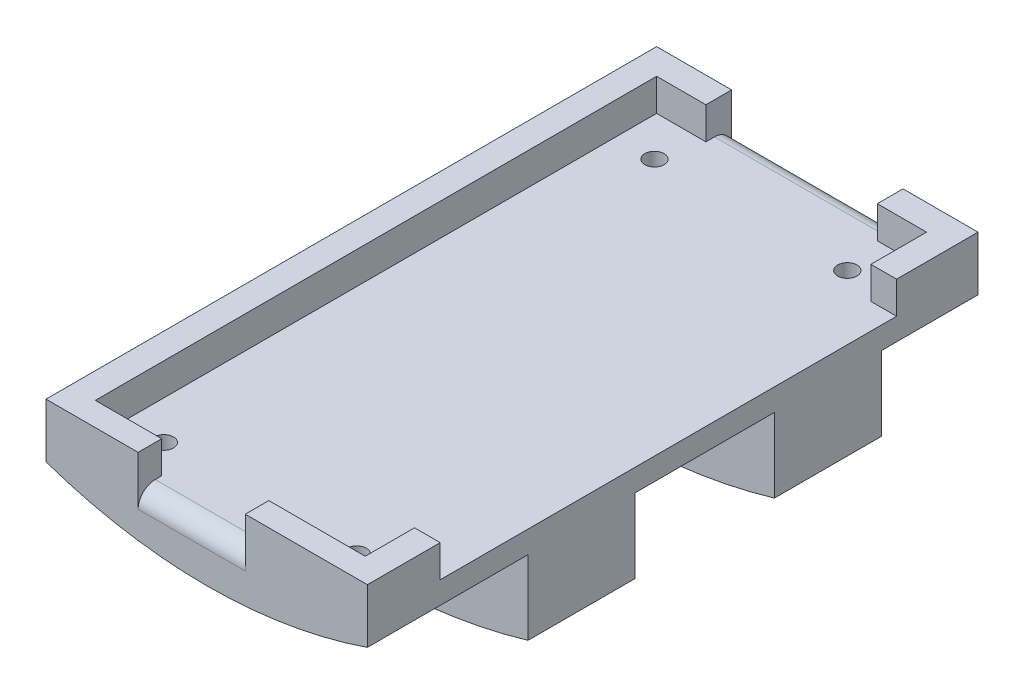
ISO-10303-21;
HEADER;
FILE_DESCRIPTION(('STEP AP214'),'2;1');
FILE_NAME('part.step','',(''),(''),'','','');
FILE_SCHEMA(('AUTOMOTIVE_DESIGN { 1 0 10303 214 1 1 1 1 }'));
ENDSEC;
DATA;
#1=APPLICATION_CONTEXT('core data for automotive mechanical design processes');
#2=APPLICATION_PROTOCOL_DEFINITION('international standard','automotive_design',2000,#1);
#3=PRODUCT_CONTEXT('',#1,'mechanical');
#4=PRODUCT('Part','Part','',(#3));
#5=PRODUCT_RELATED_PRODUCT_CATEGORY('part','',(#4));
#6=PRODUCT_DEFINITION_FORMATION('','',#4);
#7=PRODUCT_DEFINITION_CONTEXT('part definition',#1,'design');
#8=PRODUCT_DEFINITION('design','',#6,#7);
#9=PRODUCT_DEFINITION_SHAPE('','',#8);
#10=(LENGTH_UNIT() NAMED_UNIT(*) SI_UNIT(.MILLI.,.METRE.));
#11=(NAMED_UNIT(*) PLANE_ANGLE_UNIT() SI_UNIT($,.RADIAN.));
#12=(NAMED_UNIT(*) SI_UNIT($,.STERADIAN.) SOLID_ANGLE_UNIT());
#13=UNCERTAINTY_MEASURE_WITH_UNIT(LENGTH_MEASURE(1.E-05),#10,'distance_accuracy_value','');
#14=(GEOMETRIC_REPRESENTATION_CONTEXT(3) GLOBAL_UNCERTAINTY_ASSIGNED_CONTEXT((#13)) GLOBAL_UNIT_ASSIGNED_CONTEXT((#10,
#11,#12)) REPRESENTATION_CONTEXT('',''));
#15=CARTESIAN_POINT('',(0.,0.,0.));
#16=DIRECTION('',(0.,0.,1.));
#17=DIRECTION('',(1.,0.,0.));
#18=AXIS2_PLACEMENT_3D('',#15,#16,#17);
#19=CARTESIAN_POINT('',(-19.05,9.63184444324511,72.39));
#20=DIRECTION('',(0.,1.,0.));
#21=DIRECTION('',(-1.,0.,0.));
#22=AXIS2_PLACEMENT_3D('',#19,#20,#21);
#23=PLANE('',#22);
#24=DIRECTION('',(0.,0.,-1.));
#25=VECTOR('',#24,1.);
#26=CARTESIAN_POINT('',(-8.128,9.6318444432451,72.39));
#27=LINE('',#26,#25);
#28=CARTESIAN_POINT('',(-8.128,9.6318444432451,72.39));
#29=VERTEX_POINT('',#28);
#30=CARTESIAN_POINT('',(-8.128,9.6318444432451,69.596));
#31=VERTEX_POINT('',#30);
#32=EDGE_CURVE('E685',#29,#31,#27,.T.);
#33=ORIENTED_EDGE('',*,*,#32,.T.);
#34=DIRECTION('',(1.,0.,0.));
#35=VECTOR('',#34,1.);
#36=CARTESIAN_POINT('',(-16.002,9.63184444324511,69.596));
#37=LINE('',#36,#35);
#38=CARTESIAN_POINT('',(-16.002,9.63184444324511,69.596));
#39=VERTEX_POINT('',#38);
#40=EDGE_CURVE('E763',#39,#31,#37,.T.);
#41=ORIENTED_EDGE('',*,*,#40,.F.);
#42=DIRECTION('',(0.,0.,-1.));
#43=VECTOR('',#42,1.);
#44=CARTESIAN_POINT('',(-16.002,9.63184444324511,69.596));
#45=LINE('',#44,#43);
#46=CARTESIAN_POINT('',(-16.002,9.63184444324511,3.048));
#47=VERTEX_POINT('',#46);
#48=EDGE_CURVE('E776',#39,#47,#45,.T.);
#49=ORIENTED_EDGE('',*,*,#48,.T.);
#50=DIRECTION('',(1.,0.,0.));
#51=VECTOR('',#50,1.);
#52=CARTESIAN_POINT('',(-16.002,9.63184444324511,3.048));
#53=LINE('',#52,#51);
#54=CARTESIAN_POINT('',(-10.16,9.63184444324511,3.048));
#55=VERTEX_POINT('',#54);
#56=EDGE_CURVE('E781',#47,#55,#53,.T.);
#57=ORIENTED_EDGE('',*,*,#56,.T.);
#58=DIRECTION('',(0.,0.,-1.));
#59=VECTOR('',#58,1.);
#60=CARTESIAN_POINT('',(-10.16,9.63184444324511,5.08));
#61=LINE('',#60,#59);
#62=CARTESIAN_POINT('',(-10.16,9.63184444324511,0.));
#63=VERTEX_POINT('',#62);
#64=EDGE_CURVE('E741',#55,#63,#61,.T.);
#65=ORIENTED_EDGE('',*,*,#64,.T.);
#66=DIRECTION('',(1.,0.,0.));
#67=VECTOR('',#66,1.);
#68=CARTESIAN_POINT('',(-19.05,9.63184444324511,0.));
#69=LINE('',#68,#67);
#70=CARTESIAN_POINT('',(-19.05,9.63184444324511,0.));
#71=VERTEX_POINT('',#70);
#72=EDGE_CURVE('E891',#71,#63,#69,.T.);
#73=ORIENTED_EDGE('',*,*,#72,.F.);
#74=DIRECTION('',(0.,0.,-1.));
#75=VECTOR('',#74,1.);
#76=CARTESIAN_POINT('',(-19.05,9.63184444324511,72.39));
#77=LINE('',#76,#75);
#78=CARTESIAN_POINT('',(-19.05,9.63184444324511,72.39));
#79=VERTEX_POINT('',#78);
#80=EDGE_CURVE('E911',#79,#71,#77,.T.);
#81=ORIENTED_EDGE('',*,*,#80,.F.);
#82=DIRECTION('',(1.,0.,0.));
#83=VECTOR('',#82,1.);
#84=CARTESIAN_POINT('',(-19.05,9.63184444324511,72.39));
#85=LINE('',#84,#83);
#86=EDGE_CURVE('E931',#79,#29,#85,.T.);
#87=ORIENTED_EDGE('',*,*,#86,.T.);
#88=EDGE_LOOP('',(#33,#41,#49,#57,#65,#73,#81,#87));
#89=FACE_BOUND('',#88,.T.);
#90=ADVANCED_FACE('F39',(#89),#23,.T.);
#91=CARTESIAN_POINT('',(0.,0.,69.596));
#92=DIRECTION('',(0.,0.,1.));
#93=DIRECTION('',(1.,0.,0.));
#94=AXIS2_PLACEMENT_3D('',#91,#92,#93);
#95=PLANE('',#94);
#96=ORIENTED_EDGE('',*,*,#40,.T.);
#97=DIRECTION('',(0.,1.,0.));
#98=VECTOR('',#97,1.);
#99=CARTESIAN_POINT('',(-8.128,9.6318444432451,69.596));
#100=LINE('',#99,#98);
#101=CARTESIAN_POINT('',(-8.128,5.8218444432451,69.596));
#102=VERTEX_POINT('',#101);
#103=EDGE_CURVE('E676',#102,#31,#100,.T.);
#104=ORIENTED_EDGE('',*,*,#103,.F.);
#105=DIRECTION('',(-1.,0.,0.));
#106=VECTOR('',#105,1.);
#107=CARTESIAN_POINT('',(-16.002,5.82184444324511,69.596));
#108=LINE('',#107,#106);
#109=CARTESIAN_POINT('',(-16.002,5.82184444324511,69.596));
#110=VERTEX_POINT('',#109);
#111=EDGE_CURVE('E771',#102,#110,#108,.T.);
#112=ORIENTED_EDGE('',*,*,#111,.T.);
#113=DIRECTION('',(0.,1.,0.));
#114=VECTOR('',#113,1.);
#115=CARTESIAN_POINT('',(-16.002,9.63184444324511,69.596));
#116=LINE('',#115,#114);
#117=EDGE_CURVE('E757',#110,#39,#116,.T.);
#118=ORIENTED_EDGE('',*,*,#117,.T.);
#119=EDGE_LOOP('',(#96,#104,#112,#118));
#120=FACE_BOUND('',#119,.T.);
#121=ADVANCED_FACE('F1056',(#120),#95,.F.);
#122=DIRECTION('',(-1.,0.,0.));
#123=VECTOR('',#122,1.);
#124=CARTESIAN_POINT('',(19.05,9.63184444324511,9.65199999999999));
#125=LINE('',#124,#123);
#126=CARTESIAN_POINT('',(19.05,9.63184444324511,9.65199999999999));
#127=VERTEX_POINT('',#126);
#128=CARTESIAN_POINT('',(16.002,9.6318444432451,9.65199999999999));
#129=VERTEX_POINT('',#128);
#130=EDGE_CURVE('E722',#127,#129,#125,.T.);
#131=ORIENTED_EDGE('',*,*,#130,.F.);
#132=DIRECTION('',(0.,0.,-1.));
#133=VECTOR('',#132,1.);
#134=CARTESIAN_POINT('',(19.05,9.6318444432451,72.39));
#135=LINE('',#134,#133);
#136=CARTESIAN_POINT('',(19.05,9.6318444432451,0.));
#137=VERTEX_POINT('',#136);
#138=EDGE_CURVE('E924',#127,#137,#135,.T.);
#139=ORIENTED_EDGE('',*,*,#138,.T.);
#140=CARTESIAN_POINT('',(10.16,9.63184444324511,0.));
#141=VERTEX_POINT('',#140);
#142=EDGE_CURVE('E849',#141,#137,#69,.T.);
#143=ORIENTED_EDGE('',*,*,#142,.F.);
#144=DIRECTION('',(0.,0.,-1.));
#145=VECTOR('',#144,1.);
#146=CARTESIAN_POINT('',(10.16,9.63184444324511,5.08));
#147=LINE('',#146,#145);
#148=CARTESIAN_POINT('',(10.16,9.63184444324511,3.048));
#149=VERTEX_POINT('',#148);
#150=EDGE_CURVE('E751',#149,#141,#147,.T.);
#151=ORIENTED_EDGE('',*,*,#150,.F.);
#152=CARTESIAN_POINT('',(16.002,9.6318444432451,3.048));
#153=VERTEX_POINT('',#152);
#154=EDGE_CURVE('E780',#149,#153,#53,.T.);
#155=ORIENTED_EDGE('',*,*,#154,.T.);
#156=DIRECTION('',(0.,0.,-1.));
#157=VECTOR('',#156,1.);
#158=CARTESIAN_POINT('',(16.002,9.6318444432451,69.596));
#159=LINE('',#158,#157);
#160=EDGE_CURVE('E807',#129,#153,#159,.T.);
#161=ORIENTED_EDGE('',*,*,#160,.F.);
#162=EDGE_LOOP('',(#131,#139,#143,#151,#155,#161));
#163=FACE_BOUND('',#162,.T.);
#164=ADVANCED_FACE('F1031',(#163),#23,.T.);
#165=CARTESIAN_POINT('',(16.002,9.6318444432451,69.596));
#166=DIRECTION('',(1.,0.,0.));
#167=DIRECTION('',(0.,1.,0.));
#168=AXIS2_PLACEMENT_3D('',#165,#166,#167);
#169=PLANE('',#168);
#170=DIRECTION('',(0.,0.,-1.));
#171=VECTOR('',#170,1.);
#172=CARTESIAN_POINT('',(16.002,5.8218444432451,69.596));
#173=LINE('',#172,#171);
#174=CARTESIAN_POINT('',(16.002,5.8218444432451,9.65199999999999));
#175=VERTEX_POINT('',#174);
#176=CARTESIAN_POINT('',(16.002,5.8218444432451,3.048));
#177=VERTEX_POINT('',#176);
#178=EDGE_CURVE('E802',#175,#177,#173,.T.);
#179=ORIENTED_EDGE('',*,*,#178,.F.);
#180=DIRECTION('',(0.,-1.,0.));
#181=VECTOR('',#180,1.);
#182=CARTESIAN_POINT('',(16.002,9.6318444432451,9.65199999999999));
#183=LINE('',#182,#181);
#184=EDGE_CURVE('E694',#129,#175,#183,.T.);
#185=ORIENTED_EDGE('',*,*,#184,.F.);
#186=ORIENTED_EDGE('',*,*,#160,.T.);
#187=DIRECTION('',(0.,-1.,0.));
#188=VECTOR('',#187,1.);
#189=CARTESIAN_POINT('',(16.002,9.6318444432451,3.048));
#190=LINE('',#189,#188);
#191=EDGE_CURVE('E785',#153,#177,#190,.T.);
#192=ORIENTED_EDGE('',*,*,#191,.T.);
#193=EDGE_LOOP('',(#179,#185,#186,#192));
#194=FACE_BOUND('',#193,.T.);
#195=ADVANCED_FACE('F1016',(#194),#169,.F.);
#196=CARTESIAN_POINT('',(0.,0.,3.048));
#197=DIRECTION('',(0.,0.,1.));
#198=DIRECTION('',(1.,0.,0.));
#199=AXIS2_PLACEMENT_3D('',#196,#197,#198);
#200=PLANE('',#199);
#201=DIRECTION('',(0.,-1.,0.));
#202=VECTOR('',#201,1.);
#203=CARTESIAN_POINT('',(-10.16,0.,3.048));
#204=LINE('',#203,#202);
#205=CARTESIAN_POINT('',(-10.16,5.82184444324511,3.048));
#206=VERTEX_POINT('',#205);
#207=EDGE_CURVE('E950',#55,#206,#204,.T.);
#208=ORIENTED_EDGE('',*,*,#207,.F.);
#209=ORIENTED_EDGE('',*,*,#56,.F.);
#210=DIRECTION('',(0.,1.,0.));
#211=VECTOR('',#210,1.);
#212=CARTESIAN_POINT('',(-16.002,9.63184444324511,3.048));
#213=LINE('',#212,#211);
#214=CARTESIAN_POINT('',(-16.002,5.82184444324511,3.048));
#215=VERTEX_POINT('',#214);
#216=EDGE_CURVE('E746',#215,#47,#213,.T.);
#217=ORIENTED_EDGE('',*,*,#216,.F.);
#218=DIRECTION('',(-1.,0.,0.));
#219=VECTOR('',#218,1.);
#220=CARTESIAN_POINT('',(-16.002,5.82184444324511,3.048));
#221=LINE('',#220,#219);
#222=EDGE_CURVE('E789',#206,#215,#221,.T.);
#223=ORIENTED_EDGE('',*,*,#222,.F.);
#224=EDGE_LOOP('',(#208,#209,#217,#223));
#225=FACE_BOUND('',#224,.T.);
#226=ADVANCED_FACE('F1049',(#225),#200,.T.);
#227=CARTESIAN_POINT('',(0.,58.42,72.39));
#228=DIRECTION('',(0.,0.,1.));
#229=DIRECTION('',(1.,0.,0.));
#230=AXIS2_PLACEMENT_3D('',#227,#228,#229);
#231=PLANE('',#230);
#232=DIRECTION('',(-1.,0.,0.));
#233=VECTOR('',#232,1.);
#234=CARTESIAN_POINT('',(-8.128,3.78984444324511,72.39));
#235=LINE('',#234,#233);
#236=CARTESIAN_POINT('',(4.572,3.78984444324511,72.39));
#237=VERTEX_POINT('',#236);
#238=CARTESIAN_POINT('',(-8.128,3.78984444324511,72.39));
#239=VERTEX_POINT('',#238);
#240=EDGE_CURVE('E968',#237,#239,#235,.T.);
#241=ORIENTED_EDGE('',*,*,#240,.T.);
#242=DIRECTION('',(0.,1.,0.));
#243=VECTOR('',#242,1.);
#244=CARTESIAN_POINT('',(-8.128,9.6318444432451,72.39));
#245=LINE('',#244,#243);
#246=EDGE_CURVE('E677',#239,#29,#245,.T.);
#247=ORIENTED_EDGE('',*,*,#246,.T.);
#248=ORIENTED_EDGE('',*,*,#86,.F.);
#249=DIRECTION('',(0.,-1.,0.));
#250=VECTOR('',#249,1.);
#251=CARTESIAN_POINT('',(-19.05,-25.4,72.39));
#252=LINE('',#251,#250);
#253=CARTESIAN_POINT('',(-19.05,3.19325014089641,72.39));
#254=VERTEX_POINT('',#253);
#255=EDGE_CURVE('E850',#79,#254,#252,.T.);
#256=ORIENTED_EDGE('',*,*,#255,.T.);
#257=CARTESIAN_POINT('',(0.,58.42,72.39));
#258=DIRECTION('',(0.,0.,1.));
#259=DIRECTION('',(1.,0.,0.));
#260=AXIS2_PLACEMENT_3D('',#257,#258,#259);
#261=CIRCLE('',#260,58.42);
#262=CARTESIAN_POINT('',(19.05,3.19325014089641,72.39));
#263=VERTEX_POINT('',#262);
#264=EDGE_CURVE('E845',#254,#263,#261,.T.);
#265=ORIENTED_EDGE('',*,*,#264,.T.);
#266=DIRECTION('',(0.,1.,0.));
#267=VECTOR('',#266,1.);
#268=CARTESIAN_POINT('',(19.05,127.,72.39));
#269=LINE('',#268,#267);
#270=CARTESIAN_POINT('',(19.05,9.6318444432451,72.39));
#271=VERTEX_POINT('',#270);
#272=EDGE_CURVE('E797',#263,#271,#269,.T.);
#273=ORIENTED_EDGE('',*,*,#272,.T.);
#274=CARTESIAN_POINT('',(4.572,9.6318444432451,72.39));
#275=VERTEX_POINT('',#274);
#276=EDGE_CURVE('E935',#275,#271,#85,.T.);
#277=ORIENTED_EDGE('',*,*,#276,.F.);
#278=DIRECTION('',(0.,-1.,0.));
#279=VECTOR('',#278,1.);
#280=CARTESIAN_POINT('',(4.572,9.6318444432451,72.39));
#281=LINE('',#280,#279);
#282=EDGE_CURVE('E681',#275,#237,#281,.T.);
#283=ORIENTED_EDGE('',*,*,#282,.T.);
#284=EDGE_LOOP('',(#241,#247,#248,#256,#265,#273,#277,#283));
#285=FACE_BOUND('',#284,.T.);
#286=ADVANCED_FACE('F1059',(#285),#231,.T.);
#287=CARTESIAN_POINT('',(0.,58.42,0.));
#288=DIRECTION('',(0.,0.,1.));
#289=DIRECTION('',(1.,0.,0.));
#290=AXIS2_PLACEMENT_3D('',#287,#288,#289);
#291=PLANE('',#290);
#292=DIRECTION('',(0.,1.,0.));
#293=VECTOR('',#292,1.);
#294=CARTESIAN_POINT('',(-10.16,9.63184444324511,0.));
#295=LINE('',#294,#293);
#296=CARTESIAN_POINT('',(-10.16,3.78984444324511,0.));
#297=VERTEX_POINT('',#296);
#298=EDGE_CURVE('E725',#297,#63,#295,.T.);
#299=ORIENTED_EDGE('',*,*,#298,.F.);
#300=DIRECTION('',(-1.,0.,0.));
#301=VECTOR('',#300,1.);
#302=CARTESIAN_POINT('',(0.,3.78984444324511,0.));
#303=LINE('',#302,#301);
#304=CARTESIAN_POINT('',(10.16,3.78984444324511,0.));
#305=VERTEX_POINT('',#304);
#306=EDGE_CURVE('E957',#297,#305,#303,.F.);
#307=ORIENTED_EDGE('',*,*,#306,.T.);
#308=DIRECTION('',(0.,-1.,0.));
#309=VECTOR('',#308,1.);
#310=CARTESIAN_POINT('',(10.16,9.63184444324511,0.));
#311=LINE('',#310,#309);
#312=EDGE_CURVE('E738',#141,#305,#311,.T.);
#313=ORIENTED_EDGE('',*,*,#312,.F.);
#314=ORIENTED_EDGE('',*,*,#142,.T.);
#315=DIRECTION('',(0.,1.,0.));
#316=VECTOR('',#315,1.);
#317=CARTESIAN_POINT('',(19.05,127.,0.));
#318=LINE('',#317,#316);
#319=CARTESIAN_POINT('',(19.05,3.19325014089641,0.));
#320=VERTEX_POINT('',#319);
#321=EDGE_CURVE('E907',#320,#137,#318,.T.);
#322=ORIENTED_EDGE('',*,*,#321,.F.);
#323=CARTESIAN_POINT('',(0.,58.42,0.));
#324=DIRECTION('',(0.,0.,1.));
#325=DIRECTION('',(1.,0.,0.));
#326=AXIS2_PLACEMENT_3D('',#323,#324,#325);
#327=CIRCLE('',#326,58.42);
#328=CARTESIAN_POINT('',(-19.05,3.19325014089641,0.));
#329=VERTEX_POINT('',#328);
#330=EDGE_CURVE('E815',#329,#320,#327,.T.);
#331=ORIENTED_EDGE('',*,*,#330,.F.);
#332=DIRECTION('',(0.,-1.,0.));
#333=VECTOR('',#332,1.);
#334=CARTESIAN_POINT('',(-19.05,-25.4,0.));
#335=LINE('',#334,#333);
#336=EDGE_CURVE('E879',#71,#329,#335,.T.);
#337=ORIENTED_EDGE('',*,*,#336,.F.);
#338=ORIENTED_EDGE('',*,*,#72,.T.);
#339=EDGE_LOOP('',(#299,#307,#313,#314,#322,#331,#337,#338));
#340=FACE_BOUND('',#339,.T.);
#341=ADVANCED_FACE('F1067',(#340),#291,.F.);
#342=CARTESIAN_POINT('',(19.05,127.,72.39));
#343=DIRECTION('',(-1.,0.,0.));
#344=DIRECTION('',(0.,-1.,0.));
#345=AXIS2_PLACEMENT_3D('',#342,#343,#344);
#346=PLANE('',#345);
#347=ORIENTED_EDGE('',*,*,#138,.F.);
#348=DIRECTION('',(0.,-1.,0.));
#349=VECTOR('',#348,1.);
#350=CARTESIAN_POINT('',(19.05,9.63184444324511,9.65199999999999));
#351=LINE('',#350,#349);
#352=CARTESIAN_POINT('',(19.05,5.82184444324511,9.65199999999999));
#353=VERTEX_POINT('',#352);
#354=EDGE_CURVE('E704',#127,#353,#351,.T.);
#355=ORIENTED_EDGE('',*,*,#354,.T.);
#356=DIRECTION('',(0.,0.,1.));
#357=VECTOR('',#356,1.);
#358=CARTESIAN_POINT('',(19.05,5.82184444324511,9.65199999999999));
#359=LINE('',#358,#357);
#360=CARTESIAN_POINT('',(19.05,5.82184444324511,63.754));
#361=VERTEX_POINT('',#360);
#362=EDGE_CURVE('E708',#353,#361,#359,.T.);
#363=ORIENTED_EDGE('',*,*,#362,.T.);
#364=DIRECTION('',(0.,1.,0.));
#365=VECTOR('',#364,1.);
#366=CARTESIAN_POINT('',(19.05,9.63184444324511,63.754));
#367=LINE('',#366,#365);
#368=CARTESIAN_POINT('',(19.05,9.63184444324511,63.754));
#369=VERTEX_POINT('',#368);
#370=EDGE_CURVE('E713',#361,#369,#367,.T.);
#371=ORIENTED_EDGE('',*,*,#370,.T.);
#372=EDGE_CURVE('E919',#271,#369,#135,.T.);
#373=ORIENTED_EDGE('',*,*,#372,.F.);
#374=ORIENTED_EDGE('',*,*,#272,.F.);
#375=DIRECTION('',(0.,0.,-1.));
#376=VECTOR('',#375,1.);
#377=CARTESIAN_POINT('',(19.05,3.19325014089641,72.39));
#378=LINE('',#377,#376);
#379=CARTESIAN_POINT('',(19.05,3.19325014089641,53.34));
#380=VERTEX_POINT('',#379);
#381=EDGE_CURVE('E855',#380,#263,#378,.F.);
#382=ORIENTED_EDGE('',*,*,#381,.F.);
#383=DIRECTION('',(0.,1.,0.));
#384=VECTOR('',#383,1.);
#385=CARTESIAN_POINT('',(19.05,58.42,53.34));
#386=LINE('',#385,#384);
#387=CARTESIAN_POINT('',(19.05,-5.60815555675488,53.34));
#388=VERTEX_POINT('',#387);
#389=EDGE_CURVE('E870',#388,#380,#386,.T.);
#390=ORIENTED_EDGE('',*,*,#389,.F.);
#391=DIRECTION('',(0.,0.,-1.));
#392=VECTOR('',#391,1.);
#393=CARTESIAN_POINT('',(19.05,-5.60815555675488,53.34));
#394=LINE('',#393,#392);
#395=CARTESIAN_POINT('',(19.05,-5.60815555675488,40.64));
#396=VERTEX_POINT('',#395);
#397=EDGE_CURVE('E887',#388,#396,#394,.T.);
#398=ORIENTED_EDGE('',*,*,#397,.T.);
#399=DIRECTION('',(0.,1.,0.));
#400=VECTOR('',#399,1.);
#401=CARTESIAN_POINT('',(19.05,58.42,40.64));
#402=LINE('',#401,#400);
#403=CARTESIAN_POINT('',(19.05,3.19325014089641,40.64));
#404=VERTEX_POINT('',#403);
#405=EDGE_CURVE('E890',#396,#404,#402,.T.);
#406=ORIENTED_EDGE('',*,*,#405,.T.);
#407=DIRECTION('',(0.,0.,-1.));
#408=VECTOR('',#407,1.);
#409=CARTESIAN_POINT('',(19.05,3.19325014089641,72.39));
#410=LINE('',#409,#408);
#411=CARTESIAN_POINT('',(19.05,3.19325014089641,24.13));
#412=VERTEX_POINT('',#411);
#413=EDGE_CURVE('E856',#412,#404,#410,.F.);
#414=ORIENTED_EDGE('',*,*,#413,.F.);
#415=DIRECTION('',(0.,1.,0.));
#416=VECTOR('',#415,1.);
#417=CARTESIAN_POINT('',(19.05,58.42,24.13));
#418=LINE('',#417,#416);
#419=CARTESIAN_POINT('',(19.05,-5.60815555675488,24.13));
#420=VERTEX_POINT('',#419);
#421=EDGE_CURVE('E876',#420,#412,#418,.T.);
#422=ORIENTED_EDGE('',*,*,#421,.F.);
#423=DIRECTION('',(0.,0.,-1.));
#424=VECTOR('',#423,1.);
#425=CARTESIAN_POINT('',(19.05,-5.60815555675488,24.13));
#426=LINE('',#425,#424);
#427=CARTESIAN_POINT('',(19.05,-5.60815555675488,11.43));
#428=VERTEX_POINT('',#427);
#429=EDGE_CURVE('E894',#420,#428,#426,.T.);
#430=ORIENTED_EDGE('',*,*,#429,.T.);
#431=DIRECTION('',(0.,1.,0.));
#432=VECTOR('',#431,1.);
#433=CARTESIAN_POINT('',(19.05,58.42,11.43));
#434=LINE('',#433,#432);
#435=CARTESIAN_POINT('',(19.05,3.19325014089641,11.43));
#436=VERTEX_POINT('',#435);
#437=EDGE_CURVE('E904',#428,#436,#434,.T.);
#438=ORIENTED_EDGE('',*,*,#437,.T.);
#439=DIRECTION('',(0.,0.,-1.));
#440=VECTOR('',#439,1.);
#441=CARTESIAN_POINT('',(19.05,3.19325014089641,72.39));
#442=LINE('',#441,#440);
#443=EDGE_CURVE('E817',#320,#436,#442,.F.);
#444=ORIENTED_EDGE('',*,*,#443,.F.);
#445=ORIENTED_EDGE('',*,*,#321,.T.);
#446=EDGE_LOOP('',(#347,#355,#363,#371,#373,#374,#382,#390,#398,#406,#414,#422,#430,#438,#444,#445));
#447=FACE_BOUND('',#446,.T.);
#448=ADVANCED_FACE('F1010',(#447),#346,.F.);
#449=CARTESIAN_POINT('',(-19.05,-25.4,72.39));
#450=DIRECTION('',(1.,0.,0.));
#451=DIRECTION('',(0.,1.,0.));
#452=AXIS2_PLACEMENT_3D('',#449,#450,#451);
#453=PLANE('',#452);
#454=ORIENTED_EDGE('',*,*,#80,.T.);
#455=ORIENTED_EDGE('',*,*,#336,.T.);
#456=DIRECTION('',(0.,0.,-1.));
#457=VECTOR('',#456,1.);
#458=CARTESIAN_POINT('',(-19.05,3.19325014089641,72.39));
#459=LINE('',#458,#457);
#460=CARTESIAN_POINT('',(-19.05,3.19325014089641,11.43));
#461=VERTEX_POINT('',#460);
#462=EDGE_CURVE('E811',#461,#329,#459,.T.);
#463=ORIENTED_EDGE('',*,*,#462,.F.);
#464=DIRECTION('',(0.,-1.,0.));
#465=VECTOR('',#464,1.);
#466=CARTESIAN_POINT('',(-19.05,58.42,11.43));
#467=LINE('',#466,#465);
#468=CARTESIAN_POINT('',(-19.05,-5.60815555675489,11.43));
#469=VERTEX_POINT('',#468);
#470=EDGE_CURVE('E866',#461,#469,#467,.T.);
#471=ORIENTED_EDGE('',*,*,#470,.T.);
#472=DIRECTION('',(0.,0.,-1.));
#473=VECTOR('',#472,1.);
#474=CARTESIAN_POINT('',(-19.05,-5.60815555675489,24.13));
#475=LINE('',#474,#473);
#476=CARTESIAN_POINT('',(-19.05,-5.60815555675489,24.13));
#477=VERTEX_POINT('',#476);
#478=EDGE_CURVE('E863',#469,#477,#475,.F.);
#479=ORIENTED_EDGE('',*,*,#478,.T.);
#480=DIRECTION('',(0.,-1.,0.));
#481=VECTOR('',#480,1.);
#482=CARTESIAN_POINT('',(-19.05,58.42,24.13));
#483=LINE('',#482,#481);
#484=CARTESIAN_POINT('',(-19.05,3.19325014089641,24.13));
#485=VERTEX_POINT('',#484);
#486=EDGE_CURVE('E826',#485,#477,#483,.T.);
#487=ORIENTED_EDGE('',*,*,#486,.F.);
#488=DIRECTION('',(0.,0.,-1.));
#489=VECTOR('',#488,1.);
#490=CARTESIAN_POINT('',(-19.05,3.19325014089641,72.39));
#491=LINE('',#490,#489);
#492=CARTESIAN_POINT('',(-19.05,3.19325014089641,40.64));
#493=VERTEX_POINT('',#492);
#494=EDGE_CURVE('E840',#493,#485,#491,.T.);
#495=ORIENTED_EDGE('',*,*,#494,.F.);
#496=DIRECTION('',(0.,-1.,0.));
#497=VECTOR('',#496,1.);
#498=CARTESIAN_POINT('',(-19.05,58.42,40.64));
#499=LINE('',#498,#497);
#500=CARTESIAN_POINT('',(-19.05,-5.60815555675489,40.64));
#501=VERTEX_POINT('',#500);
#502=EDGE_CURVE('E859',#493,#501,#499,.T.);
#503=ORIENTED_EDGE('',*,*,#502,.T.);
#504=DIRECTION('',(0.,0.,-1.));
#505=VECTOR('',#504,1.);
#506=CARTESIAN_POINT('',(-19.05,-5.60815555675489,53.34));
#507=LINE('',#506,#505);
#508=CARTESIAN_POINT('',(-19.05,-5.60815555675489,53.34));
#509=VERTEX_POINT('',#508);
#510=EDGE_CURVE('E841',#501,#509,#507,.F.);
#511=ORIENTED_EDGE('',*,*,#510,.T.);
#512=DIRECTION('',(0.,-1.,0.));
#513=VECTOR('',#512,1.);
#514=CARTESIAN_POINT('',(-19.05,58.42,53.34));
#515=LINE('',#514,#513);
#516=CARTESIAN_POINT('',(-19.05,3.19325014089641,53.34));
#517=VERTEX_POINT('',#516);
#518=EDGE_CURVE('E835',#517,#509,#515,.T.);
#519=ORIENTED_EDGE('',*,*,#518,.F.);
#520=DIRECTION('',(0.,0.,-1.));
#521=VECTOR('',#520,1.);
#522=CARTESIAN_POINT('',(-19.05,3.19325014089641,72.39));
#523=LINE('',#522,#521);
#524=EDGE_CURVE('E851',#254,#517,#523,.T.);
#525=ORIENTED_EDGE('',*,*,#524,.F.);
#526=ORIENTED_EDGE('',*,*,#255,.F.);
#527=EDGE_LOOP('',(#454,#455,#463,#471,#479,#487,#495,#503,#511,#519,#525,#526));
#528=FACE_BOUND('',#527,.T.);
#529=ADVANCED_FACE('F1063',(#528),#453,.F.);
#530=CARTESIAN_POINT('',(0.,58.42,72.39));
#531=DIRECTION('',(0.,0.,-1.));
#532=DIRECTION('',(-1.,0.,0.));
#533=AXIS2_PLACEMENT_3D('',#530,#531,#532);
#534=CYLINDRICAL_SURFACE('',#533,58.42);
#535=CARTESIAN_POINT('',(0.,58.42,40.64));
#536=DIRECTION('',(0.,0.,-1.));
#537=DIRECTION('',(-1.,0.,0.));
#538=AXIS2_PLACEMENT_3D('',#535,#536,#537);
#539=CIRCLE('',#538,58.42);
#540=EDGE_CURVE('E836',#404,#493,#539,.T.);
#541=ORIENTED_EDGE('',*,*,#540,.T.);
#542=ORIENTED_EDGE('',*,*,#494,.T.);
#543=CARTESIAN_POINT('',(0.,58.42,24.13));
#544=DIRECTION('',(0.,0.,-1.));
#545=DIRECTION('',(-1.,0.,0.));
#546=AXIS2_PLACEMENT_3D('',#543,#544,#545);
#547=CIRCLE('',#546,58.42);
#548=EDGE_CURVE('E822',#412,#485,#547,.T.);
#549=ORIENTED_EDGE('',*,*,#548,.F.);
#550=ORIENTED_EDGE('',*,*,#413,.T.);
#551=EDGE_LOOP('',(#541,#542,#549,#550));
#552=FACE_BOUND('',#551,.T.);
#553=ADVANCED_FACE('F1086',(#552),#534,.T.);
#554=CARTESIAN_POINT('',(0.,58.42,68.0720000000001));
#555=DIRECTION('',(0.,0.,1.));
#556=DIRECTION('',(1.,0.,0.));
#557=AXIS2_PLACEMENT_3D('',#554,#555,#556);
#558=CIRCLE('',#557,58.42);
#559=CARTESIAN_POINT('',(12.6031757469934,1.37566319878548,68.072));
#560=VERTEX_POINT('',#559);
#561=CARTESIAN_POINT('',(10.2568242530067,0.9074452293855,68.072));
#562=VERTEX_POINT('',#561);
#563=EDGE_CURVE('E535',#560,#562,#558,.F.);
#564=ORIENTED_EDGE('',*,*,#563,.F.);
#565=CARTESIAN_POINT('',(0.,58.42,89.9013407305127));
#566=DIRECTION('',(0.866025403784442,0.,0.499999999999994));
#567=DIRECTION('',(0.499999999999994,0.,-0.866025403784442));
#568=AXIS2_PLACEMENT_3D('',#565,#566,#567);
#569=ELLIPSE('',#568,116.840000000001,58.42);
#570=CARTESIAN_POINT('',(13.7763514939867,1.64757236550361,66.04));
#571=VERTEX_POINT('',#570);
#572=EDGE_CURVE('E539',#571,#560,#569,.F.);
#573=ORIENTED_EDGE('',*,*,#572,.F.);
#574=CARTESIAN_POINT('',(0.,58.42,42.1786592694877));
#575=DIRECTION('',(0.866025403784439,0.,-0.5));
#576=DIRECTION('',(-0.5,0.,-0.866025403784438));
#577=AXIS2_PLACEMENT_3D('',#574,#575,#576);
#578=ELLIPSE('',#577,116.84,58.42);
#579=CARTESIAN_POINT('',(12.6031757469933,1.37566319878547,64.008));
#580=VERTEX_POINT('',#579);
#581=EDGE_CURVE('E458',#580,#571,#578,.F.);
#582=ORIENTED_EDGE('',*,*,#581,.F.);
#583=CARTESIAN_POINT('',(0.,58.42,64.0080000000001));
#584=DIRECTION('',(0.,0.,-1.));
#585=DIRECTION('',(-1.,0.,0.));
#586=AXIS2_PLACEMENT_3D('',#583,#584,#585);
#587=CIRCLE('',#586,58.42);
#588=CARTESIAN_POINT('',(10.2568242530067,0.907445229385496,64.008));
#589=VERTEX_POINT('',#588);
#590=EDGE_CURVE('E55',#589,#580,#587,.F.);
#591=ORIENTED_EDGE('',*,*,#590,.F.);
#592=CARTESIAN_POINT('',(0.,58.42,81.7733407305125));
#593=DIRECTION('',(-0.866025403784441,0.,-0.499999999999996));
#594=DIRECTION('',(0.499999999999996,0.,-0.866025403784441));
#595=AXIS2_PLACEMENT_3D('',#592,#593,#594);
#596=ELLIPSE('',#595,116.840000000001,58.42);
#597=CARTESIAN_POINT('',(9.08364850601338,0.710523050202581,66.04));
#598=VERTEX_POINT('',#597);
#599=EDGE_CURVE('E527',#598,#589,#596,.F.);
#600=ORIENTED_EDGE('',*,*,#599,.F.);
#601=CARTESIAN_POINT('',(0.,58.42,50.306659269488));
#602=DIRECTION('',(-0.866025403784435,0.,0.500000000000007));
#603=DIRECTION('',(-0.500000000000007,0.,-0.866025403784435));
#604=AXIS2_PLACEMENT_3D('',#601,#602,#603);
#605=ELLIPSE('',#604,116.839999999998,58.42);
#606=EDGE_CURVE('E531',#562,#598,#605,.F.);
#607=ORIENTED_EDGE('',*,*,#606,.F.);
#608=EDGE_LOOP('',(#564,#573,#582,#591,#600,#607));
#609=FACE_BOUND('',#608,.T.);
#610=CARTESIAN_POINT('',(0.,58.42,68.072));
#611=DIRECTION('',(0.,0.,1.));
#612=DIRECTION('',(1.,0.,0.));
#613=AXIS2_PLACEMENT_3D('',#610,#611,#612);
#614=CIRCLE('',#613,58.42);
#615=CARTESIAN_POINT('',(-10.2568242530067,0.907445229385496,68.072));
#616=VERTEX_POINT('',#615);
#617=CARTESIAN_POINT('',(-12.6031757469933,1.37566319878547,68.072));
#618=VERTEX_POINT('',#617);
#619=EDGE_CURVE('E466',#616,#618,#614,.F.);
#620=ORIENTED_EDGE('',*,*,#619,.F.);
#621=CARTESIAN_POINT('',(0.,58.42,50.3066592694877));
#622=DIRECTION('',(0.866025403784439,0.,0.499999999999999));
#623=DIRECTION('',(0.499999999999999,0.,-0.866025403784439));
#624=AXIS2_PLACEMENT_3D('',#621,#622,#623);
#625=ELLIPSE('',#624,116.84,58.42);
#626=CARTESIAN_POINT('',(-9.08364850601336,0.710523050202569,66.04));
#627=VERTEX_POINT('',#626);
#628=EDGE_CURVE('E470',#627,#616,#625,.F.);
#629=ORIENTED_EDGE('',*,*,#628,.F.);
#630=CARTESIAN_POINT('',(0.,58.42,81.7733407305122));
#631=DIRECTION('',(0.866025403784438,0.,-0.500000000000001));
#632=DIRECTION('',(-0.500000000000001,0.,-0.866025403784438));
#633=AXIS2_PLACEMENT_3D('',#630,#631,#632);
#634=ELLIPSE('',#633,116.84,58.42);
#635=CARTESIAN_POINT('',(-10.2568242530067,0.90744522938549,64.008));
#636=VERTEX_POINT('',#635);
#637=EDGE_CURVE('E520',#636,#627,#634,.F.);
#638=ORIENTED_EDGE('',*,*,#637,.F.);
#639=CARTESIAN_POINT('',(0.,58.42,64.008));
#640=DIRECTION('',(0.,0.,-1.));
#641=DIRECTION('',(-1.,0.,0.));
#642=AXIS2_PLACEMENT_3D('',#639,#640,#641);
#643=CIRCLE('',#642,58.42);
#644=CARTESIAN_POINT('',(-12.6031757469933,1.37566319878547,64.008));
#645=VERTEX_POINT('',#644);
#646=EDGE_CURVE('E63',#645,#636,#643,.F.);
#647=ORIENTED_EDGE('',*,*,#646,.F.);
#648=CARTESIAN_POINT('',(0.,58.42,42.1786592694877));
#649=DIRECTION('',(-0.866025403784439,0.,-0.5));
#650=DIRECTION('',(0.5,0.,-0.866025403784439));
#651=AXIS2_PLACEMENT_3D('',#648,#649,#650);
#652=ELLIPSE('',#651,116.84,58.42);
#653=CARTESIAN_POINT('',(-13.7763514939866,1.64757236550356,66.04));
#654=VERTEX_POINT('',#653);
#655=EDGE_CURVE('E457',#654,#645,#652,.F.);
#656=ORIENTED_EDGE('',*,*,#655,.F.);
#657=CARTESIAN_POINT('',(0.,58.42,89.9013407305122));
#658=DIRECTION('',(-0.866025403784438,0.,0.5));
#659=DIRECTION('',(-0.5,0.,-0.866025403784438));
#660=AXIS2_PLACEMENT_3D('',#657,#658,#659);
#661=ELLIPSE('',#660,116.84,58.42);
#662=EDGE_CURVE('E462',#618,#654,#661,.F.);
#663=ORIENTED_EDGE('',*,*,#662,.F.);
#664=EDGE_LOOP('',(#620,#629,#638,#647,#656,#663));
#665=FACE_BOUND('',#664,.T.);
#666=ORIENTED_EDGE('',*,*,#264,.F.);
#667=ORIENTED_EDGE('',*,*,#524,.T.);
#668=CARTESIAN_POINT('',(0.,58.42,53.34));
#669=DIRECTION('',(0.,0.,-1.));
#670=DIRECTION('',(-1.,0.,0.));
#671=AXIS2_PLACEMENT_3D('',#668,#669,#670);
#672=CIRCLE('',#671,58.42);
#673=EDGE_CURVE('E821',#380,#517,#672,.T.);
#674=ORIENTED_EDGE('',*,*,#673,.F.);
#675=ORIENTED_EDGE('',*,*,#381,.T.);
#676=EDGE_LOOP('',(#666,#667,#674,#675));
#677=FACE_BOUND('',#676,.T.);
#678=ADVANCED_FACE('F1103',(#609,#665,#677),#534,.T.);
#679=CARTESIAN_POINT('',(0.,58.42,53.34));
#680=DIRECTION('',(0.,0.,-1.));
#681=DIRECTION('',(-1.,0.,0.));
#682=AXIS2_PLACEMENT_3D('',#679,#680,#681);
#683=CYLINDRICAL_SURFACE('',#682,66.802);
#684=ORIENTED_EDGE('',*,*,#510,.F.);
#685=CARTESIAN_POINT('',(0.,58.42,40.64));
#686=DIRECTION('',(0.,0.,-1.));
#687=DIRECTION('',(-1.,0.,0.));
#688=AXIS2_PLACEMENT_3D('',#685,#686,#687);
#689=CIRCLE('',#688,66.802);
#690=EDGE_CURVE('E827',#396,#501,#689,.T.);
#691=ORIENTED_EDGE('',*,*,#690,.F.);
#692=ORIENTED_EDGE('',*,*,#397,.F.);
#693=CARTESIAN_POINT('',(0.,58.42,53.34));
#694=DIRECTION('',(0.,0.,-1.));
#695=DIRECTION('',(-1.,0.,0.));
#696=AXIS2_PLACEMENT_3D('',#693,#694,#695);
#697=CIRCLE('',#696,66.802);
#698=EDGE_CURVE('E883',#388,#509,#697,.T.);
#699=ORIENTED_EDGE('',*,*,#698,.T.);
#700=EDGE_LOOP('',(#684,#691,#692,#699));
#701=FACE_BOUND('',#700,.T.);
#702=ADVANCED_FACE('F1096',(#701),#683,.T.);
#703=CARTESIAN_POINT('',(0.,58.42,24.13));
#704=DIRECTION('',(0.,0.,-1.));
#705=DIRECTION('',(-1.,0.,0.));
#706=AXIS2_PLACEMENT_3D('',#703,#704,#705);
#707=CYLINDRICAL_SURFACE('',#706,66.802);
#708=ORIENTED_EDGE('',*,*,#478,.F.);
#709=CARTESIAN_POINT('',(0.,58.42,11.43));
#710=DIRECTION('',(0.,0.,-1.));
#711=DIRECTION('',(-1.,0.,0.));
#712=AXIS2_PLACEMENT_3D('',#709,#710,#711);
#713=CIRCLE('',#712,66.802);
#714=EDGE_CURVE('E901',#428,#469,#713,.T.);
#715=ORIENTED_EDGE('',*,*,#714,.F.);
#716=ORIENTED_EDGE('',*,*,#429,.F.);
#717=CARTESIAN_POINT('',(0.,58.42,24.13));
#718=DIRECTION('',(0.,0.,-1.));
#719=DIRECTION('',(-1.,0.,0.));
#720=AXIS2_PLACEMENT_3D('',#717,#718,#719);
#721=CIRCLE('',#720,66.802);
#722=EDGE_CURVE('E831',#420,#477,#721,.T.);
#723=ORIENTED_EDGE('',*,*,#722,.T.);
#724=EDGE_LOOP('',(#708,#715,#716,#723));
#725=FACE_BOUND('',#724,.T.);
#726=ADVANCED_FACE('F1080',(#725),#707,.T.);
#727=CARTESIAN_POINT('',(0.,58.42,9.90600000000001));
#728=DIRECTION('',(0.,0.,1.));
#729=DIRECTION('',(1.,0.,0.));
#730=AXIS2_PLACEMENT_3D('',#727,#728,#729);
#731=CIRCLE('',#730,58.42);
#732=CARTESIAN_POINT('',(-10.2568242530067,0.907445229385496,9.90600000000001));
#733=VERTEX_POINT('',#732);
#734=CARTESIAN_POINT('',(-12.6031757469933,1.37566319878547,9.906));
#735=VERTEX_POINT('',#734);
#736=EDGE_CURVE('E410',#733,#735,#731,.F.);
#737=ORIENTED_EDGE('',*,*,#736,.F.);
#738=CARTESIAN_POINT('',(0.,58.42,-7.85934073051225));
#739=DIRECTION('',(0.866025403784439,0.,0.5));
#740=DIRECTION('',(0.5,0.,-0.866025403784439));
#741=AXIS2_PLACEMENT_3D('',#738,#739,#740);
#742=ELLIPSE('',#741,116.84,58.42);
#743=CARTESIAN_POINT('',(-9.08364850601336,0.71052305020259,7.874));
#744=VERTEX_POINT('',#743);
#745=EDGE_CURVE('E385',#744,#733,#742,.F.);
#746=ORIENTED_EDGE('',*,*,#745,.F.);
#747=CARTESIAN_POINT('',(0.,58.42,23.6073407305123));
#748=DIRECTION('',(0.866025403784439,0.,-0.5));
#749=DIRECTION('',(-0.5,0.,-0.866025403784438));
#750=AXIS2_PLACEMENT_3D('',#747,#748,#749);
#751=ELLIPSE('',#750,116.84,58.42);
#752=CARTESIAN_POINT('',(-10.2568242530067,0.90744522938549,5.84200000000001));
#753=VERTEX_POINT('',#752);
#754=EDGE_CURVE('E398',#753,#744,#751,.F.);
#755=ORIENTED_EDGE('',*,*,#754,.F.);
#756=CARTESIAN_POINT('',(0.,58.42,5.842));
#757=DIRECTION('',(0.,0.,-1.));
#758=DIRECTION('',(-1.,0.,0.));
#759=AXIS2_PLACEMENT_3D('',#756,#757,#758);
#760=CIRCLE('',#759,58.42);
#761=CARTESIAN_POINT('',(-12.6031757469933,1.37566319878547,5.842));
#762=VERTEX_POINT('',#761);
#763=EDGE_CURVE('E524',#762,#753,#760,.F.);
#764=ORIENTED_EDGE('',*,*,#763,.F.);
#765=CARTESIAN_POINT('',(0.,58.42,-15.9873407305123));
#766=DIRECTION('',(-0.866025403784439,0.,-0.5));
#767=DIRECTION('',(0.5,0.,-0.866025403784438));
#768=AXIS2_PLACEMENT_3D('',#765,#766,#767);
#769=ELLIPSE('',#768,116.84,58.42);
#770=CARTESIAN_POINT('',(-13.7763514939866,1.64757236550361,7.874));
#771=VERTEX_POINT('',#770);
#772=EDGE_CURVE('E1516',#771,#762,#769,.F.);
#773=ORIENTED_EDGE('',*,*,#772,.F.);
#774=CARTESIAN_POINT('',(0.,58.42,31.7353407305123));
#775=DIRECTION('',(-0.866025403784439,0.,0.5));
#776=DIRECTION('',(-0.5,0.,-0.866025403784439));
#777=AXIS2_PLACEMENT_3D('',#774,#775,#776);
#778=ELLIPSE('',#777,116.84,58.42);
#779=EDGE_CURVE('E417',#735,#771,#778,.F.);
#780=ORIENTED_EDGE('',*,*,#779,.F.);
#781=EDGE_LOOP('',(#737,#746,#755,#764,#773,#780));
#782=FACE_BOUND('',#781,.T.);
#783=CARTESIAN_POINT('',(0.,58.42,9.90600000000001));
#784=DIRECTION('',(0.,0.,1.));
#785=DIRECTION('',(1.,0.,0.));
#786=AXIS2_PLACEMENT_3D('',#783,#784,#785);
#787=CIRCLE('',#786,58.42);
#788=CARTESIAN_POINT('',(12.6031757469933,1.37566319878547,9.906));
#789=VERTEX_POINT('',#788);
#790=CARTESIAN_POINT('',(10.2568242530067,0.9074452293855,9.906));
#791=VERTEX_POINT('',#790);
#792=EDGE_CURVE('E602',#789,#791,#787,.F.);
#793=ORIENTED_EDGE('',*,*,#792,.F.);
#794=CARTESIAN_POINT('',(0.,58.42,31.7353407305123));
#795=DIRECTION('',(0.866025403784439,0.,0.5));
#796=DIRECTION('',(0.5,0.,-0.866025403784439));
#797=AXIS2_PLACEMENT_3D('',#794,#795,#796);
#798=ELLIPSE('',#797,116.84,58.42);
#799=CARTESIAN_POINT('',(13.7763514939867,1.6475723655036,7.874));
#800=VERTEX_POINT('',#799);
#801=EDGE_CURVE('E606',#800,#789,#798,.F.);
#802=ORIENTED_EDGE('',*,*,#801,.F.);
#803=CARTESIAN_POINT('',(0.,58.42,-15.9873407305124));
#804=DIRECTION('',(0.86602540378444,0.,-0.499999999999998));
#805=DIRECTION('',(-0.499999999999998,0.,-0.86602540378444));
#806=AXIS2_PLACEMENT_3D('',#803,#804,#805);
#807=ELLIPSE('',#806,116.84,58.42);
#808=CARTESIAN_POINT('',(12.6031757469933,1.37566319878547,5.84199999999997));
#809=VERTEX_POINT('',#808);
#810=EDGE_CURVE('E656',#809,#800,#807,.F.);
#811=ORIENTED_EDGE('',*,*,#810,.F.);
#812=CARTESIAN_POINT('',(0.,58.42,5.842));
#813=DIRECTION('',(0.,0.,-1.));
#814=DIRECTION('',(-1.,0.,0.));
#815=AXIS2_PLACEMENT_3D('',#812,#813,#814);
#816=CIRCLE('',#815,58.42);
#817=CARTESIAN_POINT('',(10.2568242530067,0.907445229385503,5.842));
#818=VERTEX_POINT('',#817);
#819=EDGE_CURVE('E403',#818,#809,#816,.F.);
#820=ORIENTED_EDGE('',*,*,#819,.F.);
#821=CARTESIAN_POINT('',(0.,58.42,23.6073407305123));
#822=DIRECTION('',(-0.866025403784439,0.,-0.5));
#823=DIRECTION('',(0.5,0.,-0.866025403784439));
#824=AXIS2_PLACEMENT_3D('',#821,#822,#823);
#825=ELLIPSE('',#824,116.84,58.42);
#826=CARTESIAN_POINT('',(9.08364850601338,0.710523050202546,7.874));
#827=VERTEX_POINT('',#826);
#828=EDGE_CURVE('E594',#827,#818,#825,.F.);
#829=ORIENTED_EDGE('',*,*,#828,.F.);
#830=CARTESIAN_POINT('',(0.,58.42,-7.85934073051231));
#831=DIRECTION('',(-0.866025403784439,0.,0.5));
#832=DIRECTION('',(-0.5,0.,-0.866025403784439));
#833=AXIS2_PLACEMENT_3D('',#830,#831,#832);
#834=ELLIPSE('',#833,116.84,58.42);
#835=EDGE_CURVE('E598',#791,#827,#834,.F.);
#836=ORIENTED_EDGE('',*,*,#835,.F.);
#837=EDGE_LOOP('',(#793,#802,#811,#820,#829,#836));
#838=FACE_BOUND('',#837,.T.);
#839=CARTESIAN_POINT('',(0.,58.42,11.43));
#840=DIRECTION('',(0.,0.,-1.));
#841=DIRECTION('',(-1.,0.,0.));
#842=AXIS2_PLACEMENT_3D('',#839,#840,#841);
#843=CIRCLE('',#842,58.42);
#844=EDGE_CURVE('E816',#436,#461,#843,.T.);
#845=ORIENTED_EDGE('',*,*,#844,.T.);
#846=ORIENTED_EDGE('',*,*,#462,.T.);
#847=ORIENTED_EDGE('',*,*,#330,.T.);
#848=ORIENTED_EDGE('',*,*,#443,.T.);
#849=EDGE_LOOP('',(#845,#846,#847,#848));
#850=FACE_BOUND('',#849,.T.);
#851=ADVANCED_FACE('F406',(#782,#838,#850),#534,.T.);
#852=CARTESIAN_POINT('',(0.,58.42,53.34));
#853=DIRECTION('',(0.,0.,-1.));
#854=DIRECTION('',(-1.,0.,0.));
#855=AXIS2_PLACEMENT_3D('',#852,#853,#854);
#856=PLANE('',#855);
#857=ORIENTED_EDGE('',*,*,#673,.T.);
#858=ORIENTED_EDGE('',*,*,#518,.T.);
#859=ORIENTED_EDGE('',*,*,#698,.F.);
#860=ORIENTED_EDGE('',*,*,#389,.T.);
#861=EDGE_LOOP('',(#857,#858,#859,#860));
#862=FACE_BOUND('',#861,.T.);
#863=ADVANCED_FACE('F1099',(#862),#856,.F.);
#864=CARTESIAN_POINT('',(0.,58.42,40.64));
#865=DIRECTION('',(0.,0.,-1.));
#866=DIRECTION('',(-1.,0.,0.));
#867=AXIS2_PLACEMENT_3D('',#864,#865,#866);
#868=PLANE('',#867);
#869=ORIENTED_EDGE('',*,*,#502,.F.);
#870=ORIENTED_EDGE('',*,*,#540,.F.);
#871=ORIENTED_EDGE('',*,*,#405,.F.);
#872=ORIENTED_EDGE('',*,*,#690,.T.);
#873=EDGE_LOOP('',(#869,#870,#871,#872));
#874=FACE_BOUND('',#873,.T.);
#875=ADVANCED_FACE('F1091',(#874),#868,.T.);
#876=CARTESIAN_POINT('',(0.,58.42,24.13));
#877=DIRECTION('',(0.,0.,-1.));
#878=DIRECTION('',(-1.,0.,0.));
#879=AXIS2_PLACEMENT_3D('',#876,#877,#878);
#880=PLANE('',#879);
#881=ORIENTED_EDGE('',*,*,#548,.T.);
#882=ORIENTED_EDGE('',*,*,#486,.T.);
#883=ORIENTED_EDGE('',*,*,#722,.F.);
#884=ORIENTED_EDGE('',*,*,#421,.T.);
#885=EDGE_LOOP('',(#881,#882,#883,#884));
#886=FACE_BOUND('',#885,.T.);
#887=ADVANCED_FACE('F1083',(#886),#880,.F.);
#888=CARTESIAN_POINT('',(0.,58.42,11.43));
#889=DIRECTION('',(0.,0.,-1.));
#890=DIRECTION('',(-1.,0.,0.));
#891=AXIS2_PLACEMENT_3D('',#888,#889,#890);
#892=PLANE('',#891);
#893=ORIENTED_EDGE('',*,*,#470,.F.);
#894=ORIENTED_EDGE('',*,*,#844,.F.);
#895=ORIENTED_EDGE('',*,*,#437,.F.);
#896=ORIENTED_EDGE('',*,*,#714,.T.);
#897=EDGE_LOOP('',(#893,#894,#895,#896));
#898=FACE_BOUND('',#897,.T.);
#899=ADVANCED_FACE('F1075',(#898),#892,.T.);
#900=DIRECTION('',(0.,0.,-1.));
#901=VECTOR('',#900,1.);
#902=CARTESIAN_POINT('',(4.572,9.6318444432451,72.39));
#903=LINE('',#902,#901);
#904=CARTESIAN_POINT('',(4.572,9.63184444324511,69.596));
#905=VERTEX_POINT('',#904);
#906=EDGE_CURVE('E698',#275,#905,#903,.T.);
#907=ORIENTED_EDGE('',*,*,#906,.F.);
#908=ORIENTED_EDGE('',*,*,#276,.T.);
#909=ORIENTED_EDGE('',*,*,#372,.T.);
#910=DIRECTION('',(-1.,0.,0.));
#911=VECTOR('',#910,1.);
#912=CARTESIAN_POINT('',(19.05,9.63184444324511,63.754));
#913=LINE('',#912,#911);
#914=CARTESIAN_POINT('',(16.002,9.6318444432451,63.754));
#915=VERTEX_POINT('',#914);
#916=EDGE_CURVE('E726',#369,#915,#913,.T.);
#917=ORIENTED_EDGE('',*,*,#916,.T.);
#918=CARTESIAN_POINT('',(16.002,9.6318444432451,69.596));
#919=VERTEX_POINT('',#918);
#920=EDGE_CURVE('E803',#919,#915,#159,.T.);
#921=ORIENTED_EDGE('',*,*,#920,.F.);
#922=EDGE_CURVE('E761',#905,#919,#37,.T.);
#923=ORIENTED_EDGE('',*,*,#922,.F.);
#924=EDGE_LOOP('',(#907,#908,#909,#917,#921,#923));
#925=FACE_BOUND('',#924,.T.);
#926=ADVANCED_FACE('F1003',(#925),#23,.T.);
#927=CARTESIAN_POINT('',(-16.002,9.63184444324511,69.596));
#928=DIRECTION('',(-1.,0.,0.));
#929=DIRECTION('',(0.,-1.,0.));
#930=AXIS2_PLACEMENT_3D('',#927,#928,#929);
#931=PLANE('',#930);
#932=ORIENTED_EDGE('',*,*,#216,.T.);
#933=ORIENTED_EDGE('',*,*,#48,.F.);
#934=ORIENTED_EDGE('',*,*,#117,.F.);
#935=DIRECTION('',(0.,0.,-1.));
#936=VECTOR('',#935,1.);
#937=CARTESIAN_POINT('',(-16.002,5.82184444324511,69.596));
#938=LINE('',#937,#936);
#939=EDGE_CURVE('E793',#110,#215,#938,.T.);
#940=ORIENTED_EDGE('',*,*,#939,.T.);
#941=EDGE_LOOP('',(#932,#933,#934,#940));
#942=FACE_BOUND('',#941,.T.);
#943=ADVANCED_FACE('F1051',(#942),#931,.F.);
#944=CARTESIAN_POINT('',(-16.002,5.82184444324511,69.596));
#945=DIRECTION('',(0.,-1.,0.));
#946=DIRECTION('',(1.,0.,0.));
#947=AXIS2_PLACEMENT_3D('',#944,#945,#946);
#948=PLANE('',#947);
#949=CARTESIAN_POINT('',(-11.43,5.82184444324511,66.04));
#950=DIRECTION('',(0.,1.,0.));
#951=DIRECTION('',(-1.,0.,0.));
#952=AXIS2_PLACEMENT_3D('',#949,#950,#951);
#953=CIRCLE('',#952,1.143);
#954=CARTESIAN_POINT('',(-12.573,5.82184444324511,66.04));
#955=VERTEX_POINT('',#954);
#956=EDGE_CURVE('E665',#955,#955,#953,.T.);
#957=ORIENTED_EDGE('',*,*,#956,.F.);
#958=EDGE_LOOP('',(#957));
#959=FACE_BOUND('',#958,.T.);
#960=CARTESIAN_POINT('',(11.43,5.8218444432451,7.874));
#961=DIRECTION('',(0.,1.,0.));
#962=DIRECTION('',(-1.,0.,0.));
#963=AXIS2_PLACEMENT_3D('',#960,#961,#962);
#964=CIRCLE('',#963,1.143);
#965=CARTESIAN_POINT('',(10.287,5.8218444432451,7.874));
#966=VERTEX_POINT('',#965);
#967=EDGE_CURVE('E664',#966,#966,#964,.T.);
#968=ORIENTED_EDGE('',*,*,#967,.F.);
#969=EDGE_LOOP('',(#968));
#970=FACE_BOUND('',#969,.T.);
#971=CARTESIAN_POINT('',(-11.43,5.82184444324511,7.87400000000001));
#972=DIRECTION('',(0.,1.,0.));
#973=DIRECTION('',(-1.,0.,0.));
#974=AXIS2_PLACEMENT_3D('',#971,#972,#973);
#975=CIRCLE('',#974,1.143);
#976=CARTESIAN_POINT('',(-12.573,5.82184444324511,7.87400000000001));
#977=VERTEX_POINT('',#976);
#978=EDGE_CURVE('E660',#977,#977,#975,.T.);
#979=ORIENTED_EDGE('',*,*,#978,.F.);
#980=EDGE_LOOP('',(#979));
#981=FACE_BOUND('',#980,.T.);
#982=CARTESIAN_POINT('',(11.43,5.8218444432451,66.04));
#983=DIRECTION('',(0.,1.,0.));
#984=DIRECTION('',(-1.,0.,0.));
#985=AXIS2_PLACEMENT_3D('',#982,#983,#984);
#986=CIRCLE('',#985,1.143);
#987=CARTESIAN_POINT('',(10.287,5.8218444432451,66.04));
#988=VERTEX_POINT('',#987);
#989=EDGE_CURVE('E669',#988,#988,#986,.T.);
#990=ORIENTED_EDGE('',*,*,#989,.F.);
#991=EDGE_LOOP('',(#990));
#992=FACE_BOUND('',#991,.T.);
#993=DIRECTION('',(0.,0.,-1.));
#994=VECTOR('',#993,1.);
#995=CARTESIAN_POINT('',(-8.128,5.8218444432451,72.39));
#996=LINE('',#995,#994);
#997=CARTESIAN_POINT('',(-8.128,5.8218444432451,70.358));
#998=VERTEX_POINT('',#997);
#999=EDGE_CURVE('E691',#998,#102,#996,.T.);
#1000=ORIENTED_EDGE('',*,*,#999,.F.);
#1001=DIRECTION('',(-1.,0.,0.));
#1002=VECTOR('',#1001,1.);
#1003=CARTESIAN_POINT('',(4.572,5.82184444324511,70.358));
#1004=LINE('',#1003,#1002);
#1005=CARTESIAN_POINT('',(4.572,5.8218444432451,70.358));
#1006=VERTEX_POINT('',#1005);
#1007=EDGE_CURVE('E972',#998,#1006,#1004,.F.);
#1008=ORIENTED_EDGE('',*,*,#1007,.T.);
#1009=DIRECTION('',(0.,0.,-1.));
#1010=VECTOR('',#1009,1.);
#1011=CARTESIAN_POINT('',(4.572,5.8218444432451,72.39));
#1012=LINE('',#1011,#1010);
#1013=CARTESIAN_POINT('',(4.572,5.8218444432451,69.596));
#1014=VERTEX_POINT('',#1013);
#1015=EDGE_CURVE('E695',#1006,#1014,#1012,.T.);
#1016=ORIENTED_EDGE('',*,*,#1015,.T.);
#1017=CARTESIAN_POINT('',(16.002,5.8218444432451,69.596));
#1018=VERTEX_POINT('',#1017);
#1019=EDGE_CURVE('E772',#1018,#1014,#108,.T.);
#1020=ORIENTED_EDGE('',*,*,#1019,.F.);
#1021=CARTESIAN_POINT('',(16.002,5.8218444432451,63.754));
#1022=VERTEX_POINT('',#1021);
#1023=EDGE_CURVE('E798',#1018,#1022,#173,.T.);
#1024=ORIENTED_EDGE('',*,*,#1023,.T.);
#1025=DIRECTION('',(-1.,0.,0.));
#1026=VECTOR('',#1025,1.);
#1027=CARTESIAN_POINT('',(19.05,5.82184444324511,63.754));
#1028=LINE('',#1027,#1026);
#1029=EDGE_CURVE('E730',#361,#1022,#1028,.T.);
#1030=ORIENTED_EDGE('',*,*,#1029,.F.);
#1031=ORIENTED_EDGE('',*,*,#362,.F.);
#1032=DIRECTION('',(-1.,0.,0.));
#1033=VECTOR('',#1032,1.);
#1034=CARTESIAN_POINT('',(19.05,5.82184444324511,9.65199999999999));
#1035=LINE('',#1034,#1033);
#1036=EDGE_CURVE('E717',#353,#175,#1035,.T.);
#1037=ORIENTED_EDGE('',*,*,#1036,.T.);
#1038=ORIENTED_EDGE('',*,*,#178,.T.);
#1039=CARTESIAN_POINT('',(10.16,5.82184444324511,3.048));
#1040=VERTEX_POINT('',#1039);
#1041=EDGE_CURVE('E762',#177,#1040,#221,.T.);
#1042=ORIENTED_EDGE('',*,*,#1041,.T.);
#1043=DIRECTION('',(0.,0.,-1.));
#1044=VECTOR('',#1043,1.);
#1045=CARTESIAN_POINT('',(10.16,5.82184444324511,5.08));
#1046=LINE('',#1045,#1044);
#1047=CARTESIAN_POINT('',(10.16,5.82184444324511,2.03200000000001));
#1048=VERTEX_POINT('',#1047);
#1049=EDGE_CURVE('E747',#1040,#1048,#1046,.T.);
#1050=ORIENTED_EDGE('',*,*,#1049,.T.);
#1051=DIRECTION('',(-1.,0.,0.));
#1052=VECTOR('',#1051,1.);
#1053=CARTESIAN_POINT('',(-16.002,5.82184444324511,2.03200000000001));
#1054=LINE('',#1053,#1052);
#1055=CARTESIAN_POINT('',(-10.16,5.82184444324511,2.03200000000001));
#1056=VERTEX_POINT('',#1055);
#1057=EDGE_CURVE('E953',#1048,#1056,#1054,.T.);
#1058=ORIENTED_EDGE('',*,*,#1057,.T.);
#1059=DIRECTION('',(0.,0.,-1.));
#1060=VECTOR('',#1059,1.);
#1061=CARTESIAN_POINT('',(-10.16,5.82184444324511,5.08));
#1062=LINE('',#1061,#1060);
#1063=EDGE_CURVE('E742',#206,#1056,#1062,.T.);
#1064=ORIENTED_EDGE('',*,*,#1063,.F.);
#1065=ORIENTED_EDGE('',*,*,#222,.T.);
#1066=ORIENTED_EDGE('',*,*,#939,.F.);
#1067=ORIENTED_EDGE('',*,*,#111,.F.);
#1068=EDGE_LOOP('',(#1000,#1008,#1016,#1020,#1024,#1030,#1031,#1037,#1038,#1042,#1050,#1058,
#1064,#1065,#1066,#1067));
#1069=FACE_BOUND('',#1068,.T.);
#1070=ADVANCED_FACE('F985',(#959,#970,#981,#992,#1069),#948,.F.);
#1071=ORIENTED_EDGE('',*,*,#920,.T.);
#1072=DIRECTION('',(0.,1.,0.));
#1073=VECTOR('',#1072,1.);
#1074=CARTESIAN_POINT('',(16.002,9.6318444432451,63.754));
#1075=LINE('',#1074,#1073);
#1076=EDGE_CURVE('E709',#1022,#915,#1075,.T.);
#1077=ORIENTED_EDGE('',*,*,#1076,.F.);
#1078=ORIENTED_EDGE('',*,*,#1023,.F.);
#1079=DIRECTION('',(0.,-1.,0.));
#1080=VECTOR('',#1079,1.);
#1081=CARTESIAN_POINT('',(16.002,9.6318444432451,69.596));
#1082=LINE('',#1081,#1080);
#1083=EDGE_CURVE('E767',#919,#1018,#1082,.T.);
#1084=ORIENTED_EDGE('',*,*,#1083,.F.);
#1085=EDGE_LOOP('',(#1071,#1077,#1078,#1084));
#1086=FACE_BOUND('',#1085,.T.);
#1087=ADVANCED_FACE('F1000',(#1086),#169,.F.);
#1088=ORIENTED_EDGE('',*,*,#1019,.T.);
#1089=DIRECTION('',(0.,-1.,0.));
#1090=VECTOR('',#1089,1.);
#1091=CARTESIAN_POINT('',(4.572,9.6318444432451,69.596));
#1092=LINE('',#1091,#1090);
#1093=EDGE_CURVE('E682',#905,#1014,#1092,.T.);
#1094=ORIENTED_EDGE('',*,*,#1093,.F.);
#1095=ORIENTED_EDGE('',*,*,#922,.T.);
#1096=ORIENTED_EDGE('',*,*,#1083,.T.);
#1097=EDGE_LOOP('',(#1088,#1094,#1095,#1096));
#1098=FACE_BOUND('',#1097,.T.);
#1099=ADVANCED_FACE('F995',(#1098),#95,.F.);
#1100=DIRECTION('',(0.,1.,0.));
#1101=VECTOR('',#1100,1.);
#1102=CARTESIAN_POINT('',(10.16,0.,3.048));
#1103=LINE('',#1102,#1101);
#1104=EDGE_CURVE('E923',#1040,#149,#1103,.T.);
#1105=ORIENTED_EDGE('',*,*,#1104,.F.);
#1106=ORIENTED_EDGE('',*,*,#1041,.F.);
#1107=ORIENTED_EDGE('',*,*,#191,.F.);
#1108=ORIENTED_EDGE('',*,*,#154,.F.);
#1109=EDGE_LOOP('',(#1105,#1106,#1107,#1108));
#1110=FACE_BOUND('',#1109,.T.);
#1111=ADVANCED_FACE('F1035',(#1110),#200,.T.);
#1112=CARTESIAN_POINT('',(-10.16,9.63184444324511,5.08));
#1113=DIRECTION('',(-1.,0.,0.));
#1114=DIRECTION('',(0.,0.,1.));
#1115=AXIS2_PLACEMENT_3D('',#1112,#1113,#1114);
#1116=PLANE('',#1115);
#1117=ORIENTED_EDGE('',*,*,#207,.T.);
#1118=ORIENTED_EDGE('',*,*,#1063,.T.);
#1119=CARTESIAN_POINT('',(-10.16,3.78984444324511,2.03200000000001));
#1120=DIRECTION('',(-1.,0.,0.));
#1121=DIRECTION('',(0.,0.,1.));
#1122=AXIS2_PLACEMENT_3D('',#1119,#1120,#1121);
#1123=CIRCLE('',#1122,2.032);
#1124=EDGE_CURVE('E961',#1056,#297,#1123,.T.);
#1125=ORIENTED_EDGE('',*,*,#1124,.T.);
#1126=ORIENTED_EDGE('',*,*,#298,.T.);
#1127=ORIENTED_EDGE('',*,*,#64,.F.);
#1128=EDGE_LOOP('',(#1117,#1118,#1125,#1126,#1127));
#1129=FACE_BOUND('',#1128,.T.);
#1130=ADVANCED_FACE('F1044',(#1129),#1116,.F.);
#1131=CARTESIAN_POINT('',(10.16,9.63184444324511,5.08));
#1132=DIRECTION('',(1.,0.,0.));
#1133=DIRECTION('',(0.,1.,0.));
#1134=AXIS2_PLACEMENT_3D('',#1131,#1132,#1133);
#1135=PLANE('',#1134);
#1136=ORIENTED_EDGE('',*,*,#1104,.T.);
#1137=ORIENTED_EDGE('',*,*,#150,.T.);
#1138=ORIENTED_EDGE('',*,*,#312,.T.);
#1139=CARTESIAN_POINT('',(10.16,3.78984444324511,2.03200000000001));
#1140=DIRECTION('',(1.,0.,0.));
#1141=DIRECTION('',(0.,1.,0.));
#1142=AXIS2_PLACEMENT_3D('',#1139,#1140,#1141);
#1143=CIRCLE('',#1142,2.032);
#1144=EDGE_CURVE('E965',#305,#1048,#1143,.T.);
#1145=ORIENTED_EDGE('',*,*,#1144,.T.);
#1146=ORIENTED_EDGE('',*,*,#1049,.F.);
#1147=EDGE_LOOP('',(#1136,#1137,#1138,#1145,#1146));
#1148=FACE_BOUND('',#1147,.T.);
#1149=ADVANCED_FACE('F1109',(#1148),#1135,.F.);
#1150=CARTESIAN_POINT('',(-16.002,3.78984444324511,2.03200000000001));
#1151=DIRECTION('',(-1.,0.,0.));
#1152=DIRECTION('',(0.,-1.,0.));
#1153=AXIS2_PLACEMENT_3D('',#1150,#1151,#1152);
#1154=CYLINDRICAL_SURFACE('',#1153,2.032);
#1155=ORIENTED_EDGE('',*,*,#1144,.F.);
#1156=ORIENTED_EDGE('',*,*,#306,.F.);
#1157=ORIENTED_EDGE('',*,*,#1124,.F.);
#1158=ORIENTED_EDGE('',*,*,#1057,.F.);
#1159=EDGE_LOOP('',(#1155,#1156,#1157,#1158));
#1160=FACE_BOUND('',#1159,.T.);
#1161=ADVANCED_FACE('F1041',(#1160),#1154,.T.);
#1162=CARTESIAN_POINT('',(19.05,9.63184444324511,9.65199999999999));
#1163=DIRECTION('',(0.,0.,-1.));
#1164=DIRECTION('',(-1.,0.,0.));
#1165=AXIS2_PLACEMENT_3D('',#1162,#1163,#1164);
#1166=PLANE('',#1165);
#1167=ORIENTED_EDGE('',*,*,#184,.T.);
#1168=ORIENTED_EDGE('',*,*,#1036,.F.);
#1169=ORIENTED_EDGE('',*,*,#354,.F.);
#1170=ORIENTED_EDGE('',*,*,#130,.T.);
#1171=EDGE_LOOP('',(#1167,#1168,#1169,#1170));
#1172=FACE_BOUND('',#1171,.T.);
#1173=ADVANCED_FACE('F1116',(#1172),#1166,.F.);
#1174=CARTESIAN_POINT('',(19.05,9.63184444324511,63.754));
#1175=DIRECTION('',(0.,0.,1.));
#1176=DIRECTION('',(1.,0.,0.));
#1177=AXIS2_PLACEMENT_3D('',#1174,#1175,#1176);
#1178=PLANE('',#1177);
#1179=ORIENTED_EDGE('',*,*,#1076,.T.);
#1180=ORIENTED_EDGE('',*,*,#916,.F.);
#1181=ORIENTED_EDGE('',*,*,#370,.F.);
#1182=ORIENTED_EDGE('',*,*,#1029,.T.);
#1183=EDGE_LOOP('',(#1179,#1180,#1181,#1182));
#1184=FACE_BOUND('',#1183,.T.);
#1185=ADVANCED_FACE('F1007',(#1184),#1178,.F.);
#1186=CARTESIAN_POINT('',(-8.128,9.6318444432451,72.39));
#1187=DIRECTION('',(-1.,0.,0.));
#1188=DIRECTION('',(0.,-1.,0.));
#1189=AXIS2_PLACEMENT_3D('',#1186,#1187,#1188);
#1190=PLANE('',#1189);
#1191=ORIENTED_EDGE('',*,*,#103,.T.);
#1192=ORIENTED_EDGE('',*,*,#32,.F.);
#1193=ORIENTED_EDGE('',*,*,#246,.F.);
#1194=CARTESIAN_POINT('',(-8.128,3.78984444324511,70.358));
#1195=DIRECTION('',(-1.,0.,0.));
#1196=DIRECTION('',(0.,-1.,0.));
#1197=AXIS2_PLACEMENT_3D('',#1194,#1195,#1196);
#1198=CIRCLE('',#1197,2.032);
#1199=EDGE_CURVE('E48',#239,#998,#1198,.T.);
#1200=ORIENTED_EDGE('',*,*,#1199,.T.);
#1201=ORIENTED_EDGE('',*,*,#999,.T.);
#1202=EDGE_LOOP('',(#1191,#1192,#1193,#1200,#1201));
#1203=FACE_BOUND('',#1202,.T.);
#1204=ADVANCED_FACE('F978',(#1203),#1190,.F.);
#1205=CARTESIAN_POINT('',(4.572,9.6318444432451,72.39));
#1206=DIRECTION('',(1.,0.,0.));
#1207=DIRECTION('',(0.,1.,0.));
#1208=AXIS2_PLACEMENT_3D('',#1205,#1206,#1207);
#1209=PLANE('',#1208);
#1210=ORIENTED_EDGE('',*,*,#1093,.T.);
#1211=ORIENTED_EDGE('',*,*,#1015,.F.);
#1212=CARTESIAN_POINT('',(4.572,3.78984444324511,70.358));
#1213=DIRECTION('',(1.,0.,0.));
#1214=DIRECTION('',(0.,1.,0.));
#1215=AXIS2_PLACEMENT_3D('',#1212,#1213,#1214);
#1216=CIRCLE('',#1215,2.032);
#1217=EDGE_CURVE('E11',#1006,#237,#1216,.T.);
#1218=ORIENTED_EDGE('',*,*,#1217,.T.);
#1219=ORIENTED_EDGE('',*,*,#282,.F.);
#1220=ORIENTED_EDGE('',*,*,#906,.T.);
#1221=EDGE_LOOP('',(#1210,#1211,#1218,#1219,#1220));
#1222=FACE_BOUND('',#1221,.T.);
#1223=ADVANCED_FACE('F990',(#1222),#1209,.F.);
#1224=CARTESIAN_POINT('',(0.,3.78984444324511,70.358));
#1225=DIRECTION('',(1.,0.,0.));
#1226=DIRECTION('',(0.,1.,0.));
#1227=AXIS2_PLACEMENT_3D('',#1224,#1225,#1226);
#1228=CYLINDRICAL_SURFACE('',#1227,2.032);
#1229=ORIENTED_EDGE('',*,*,#1217,.F.);
#1230=ORIENTED_EDGE('',*,*,#1007,.F.);
#1231=ORIENTED_EDGE('',*,*,#1199,.F.);
#1232=ORIENTED_EDGE('',*,*,#240,.F.);
#1233=EDGE_LOOP('',(#1229,#1230,#1231,#1232));
#1234=FACE_BOUND('',#1233,.T.);
#1235=ADVANCED_FACE('F41',(#1234),#1228,.T.);
#1236=CARTESIAN_POINT('',(11.43,-8.38200000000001,66.04));
#1237=DIRECTION('',(0.,1.,0.));
#1238=DIRECTION('',(-1.,0.,0.));
#1239=AXIS2_PLACEMENT_3D('',#1236,#1237,#1238);
#1240=CYLINDRICAL_SURFACE('',#1239,1.143);
#1241=CARTESIAN_POINT('',(11.43,3.5358444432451,66.04));
#1242=DIRECTION('',(0.,1.,0.));
#1243=DIRECTION('',(0.,0.,1.));
#1244=AXIS2_PLACEMENT_3D('',#1241,#1242,#1243);
#1245=CIRCLE('',#1244,1.143);
#1246=CARTESIAN_POINT('',(11.43,3.5358444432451,67.183));
#1247=VERTEX_POINT('',#1246);
#1248=EDGE_CURVE('E571',#1247,#1247,#1245,.T.);
#1249=ORIENTED_EDGE('',*,*,#1248,.F.);
#1250=EDGE_LOOP('',(#1249));
#1251=FACE_BOUND('',#1250,.T.);
#1252=ORIENTED_EDGE('',*,*,#989,.T.);
#1253=EDGE_LOOP('',(#1252));
#1254=FACE_BOUND('',#1253,.T.);
#1255=ADVANCED_FACE('F1328',(#1251,#1254),#1240,.F.);
#1256=CARTESIAN_POINT('',(-11.43,-8.38200000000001,7.87400000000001));
#1257=DIRECTION('',(0.,1.,0.));
#1258=DIRECTION('',(-1.,0.,0.));
#1259=AXIS2_PLACEMENT_3D('',#1256,#1257,#1258);
#1260=CYLINDRICAL_SURFACE('',#1259,1.143);
#1261=CARTESIAN_POINT('',(-11.43,3.53584444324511,7.87400000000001));
#1262=DIRECTION('',(0.,1.,0.));
#1263=DIRECTION('',(-1.,0.,0.));
#1264=AXIS2_PLACEMENT_3D('',#1261,#1262,#1263);
#1265=CIRCLE('',#1264,1.143);
#1266=CARTESIAN_POINT('',(-12.573,3.53584444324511,7.87400000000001));
#1267=VERTEX_POINT('',#1266);
#1268=EDGE_CURVE('E404',#1267,#1267,#1265,.T.);
#1269=ORIENTED_EDGE('',*,*,#1268,.F.);
#1270=EDGE_LOOP('',(#1269));
#1271=FACE_BOUND('',#1270,.T.);
#1272=ORIENTED_EDGE('',*,*,#978,.T.);
#1273=EDGE_LOOP('',(#1272));
#1274=FACE_BOUND('',#1273,.T.);
#1275=ADVANCED_FACE('F1383',(#1271,#1274),#1260,.F.);
#1276=CARTESIAN_POINT('',(11.43,-8.38200000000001,7.874));
#1277=DIRECTION('',(0.,1.,0.));
#1278=DIRECTION('',(-1.,0.,0.));
#1279=AXIS2_PLACEMENT_3D('',#1276,#1277,#1278);
#1280=CYLINDRICAL_SURFACE('',#1279,1.143);
#1281=CARTESIAN_POINT('',(11.43,3.5358444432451,7.874));
#1282=DIRECTION('',(0.,1.,0.));
#1283=DIRECTION('',(0.,0.,1.));
#1284=AXIS2_PLACEMENT_3D('',#1281,#1282,#1283);
#1285=CIRCLE('',#1284,1.143);
#1286=CARTESIAN_POINT('',(11.43,3.5358444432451,9.017));
#1287=VERTEX_POINT('',#1286);
#1288=EDGE_CURVE('E638',#1287,#1287,#1285,.T.);
#1289=ORIENTED_EDGE('',*,*,#1288,.F.);
#1290=EDGE_LOOP('',(#1289));
#1291=FACE_BOUND('',#1290,.T.);
#1292=ORIENTED_EDGE('',*,*,#967,.T.);
#1293=EDGE_LOOP('',(#1292));
#1294=FACE_BOUND('',#1293,.T.);
#1295=ADVANCED_FACE('F1388',(#1291,#1294),#1280,.F.);
#1296=CARTESIAN_POINT('',(-11.43,-8.38200000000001,66.04));
#1297=DIRECTION('',(0.,1.,0.));
#1298=DIRECTION('',(-1.,0.,0.));
#1299=AXIS2_PLACEMENT_3D('',#1296,#1297,#1298);
#1300=CYLINDRICAL_SURFACE('',#1299,1.143);
#1301=CARTESIAN_POINT('',(-11.43,3.53584444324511,66.04));
#1302=DIRECTION('',(0.,1.,0.));
#1303=DIRECTION('',(-1.,0.,0.));
#1304=AXIS2_PLACEMENT_3D('',#1301,#1302,#1303);
#1305=CIRCLE('',#1304,1.143);
#1306=CARTESIAN_POINT('',(-12.573,3.53584444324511,66.04));
#1307=VERTEX_POINT('',#1306);
#1308=EDGE_CURVE('E502',#1307,#1307,#1305,.T.);
#1309=ORIENTED_EDGE('',*,*,#1308,.F.);
#1310=EDGE_LOOP('',(#1309));
#1311=FACE_BOUND('',#1310,.T.);
#1312=ORIENTED_EDGE('',*,*,#956,.T.);
#1313=EDGE_LOOP('',(#1312));
#1314=FACE_BOUND('',#1313,.T.);
#1315=ADVANCED_FACE('F1395',(#1311,#1314),#1300,.F.);
#1316=CARTESIAN_POINT('',(-10.2568242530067,-8.38300000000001,68.072));
#1317=DIRECTION('',(0.866025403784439,0.,0.499999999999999));
#1318=DIRECTION('',(0.499999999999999,0.,-0.866025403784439));
#1319=AXIS2_PLACEMENT_3D('',#1316,#1317,#1318);
#1320=PLANE('',#1319);
#1321=ORIENTED_EDGE('',*,*,#628,.T.);
#1322=DIRECTION('',(0.,1.,0.));
#1323=VECTOR('',#1322,1.);
#1324=CARTESIAN_POINT('',(-10.2568242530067,-8.38300000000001,68.072));
#1325=LINE('',#1324,#1323);
#1326=CARTESIAN_POINT('',(-10.2568242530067,3.53584444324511,68.072));
#1327=VERTEX_POINT('',#1326);
#1328=EDGE_CURVE('E499',#616,#1327,#1325,.T.);
#1329=ORIENTED_EDGE('',*,*,#1328,.T.);
#1330=DIRECTION('',(0.499999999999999,0.,-0.866025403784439));
#1331=VECTOR('',#1330,1.);
#1332=CARTESIAN_POINT('',(-10.2568242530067,3.53584444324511,68.072));
#1333=LINE('',#1332,#1331);
#1334=CARTESIAN_POINT('',(-9.08364850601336,3.53584444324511,66.04));
#1335=VERTEX_POINT('',#1334);
#1336=EDGE_CURVE('E474',#1327,#1335,#1333,.T.);
#1337=ORIENTED_EDGE('',*,*,#1336,.T.);
#1338=DIRECTION('',(0.,1.,0.));
#1339=VECTOR('',#1338,1.);
#1340=CARTESIAN_POINT('',(-9.08364850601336,-8.38300000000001,66.04));
#1341=LINE('',#1340,#1339);
#1342=EDGE_CURVE('E498',#627,#1335,#1341,.T.);
#1343=ORIENTED_EDGE('',*,*,#1342,.F.);
#1344=EDGE_LOOP('',(#1321,#1329,#1337,#1343));
#1345=FACE_BOUND('',#1344,.T.);
#1346=ADVANCED_FACE('F1398',(#1345),#1320,.F.);
#1347=CARTESIAN_POINT('',(-12.6031757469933,-8.38300000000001,68.072));
#1348=DIRECTION('',(0.,0.,1.));
#1349=DIRECTION('',(1.,0.,0.));
#1350=AXIS2_PLACEMENT_3D('',#1347,#1348,#1349);
#1351=PLANE('',#1350);
#1352=ORIENTED_EDGE('',*,*,#619,.T.);
#1353=DIRECTION('',(0.,1.,0.));
#1354=VECTOR('',#1353,1.);
#1355=CARTESIAN_POINT('',(-12.6031757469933,-8.38300000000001,68.072));
#1356=LINE('',#1355,#1354);
#1357=CARTESIAN_POINT('',(-12.6031757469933,3.53584444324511,68.072));
#1358=VERTEX_POINT('',#1357);
#1359=EDGE_CURVE('E503',#618,#1358,#1356,.T.);
#1360=ORIENTED_EDGE('',*,*,#1359,.T.);
#1361=DIRECTION('',(1.,0.,0.));
#1362=VECTOR('',#1361,1.);
#1363=CARTESIAN_POINT('',(-12.6031757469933,3.53584444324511,68.072));
#1364=LINE('',#1363,#1362);
#1365=EDGE_CURVE('E494',#1358,#1327,#1364,.T.);
#1366=ORIENTED_EDGE('',*,*,#1365,.T.);
#1367=ORIENTED_EDGE('',*,*,#1328,.F.);
#1368=EDGE_LOOP('',(#1352,#1360,#1366,#1367));
#1369=FACE_BOUND('',#1368,.T.);
#1370=ADVANCED_FACE('F1460',(#1369),#1351,.F.);
#1371=CARTESIAN_POINT('',(-13.7763514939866,-8.38300000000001,66.04));
#1372=DIRECTION('',(-0.866025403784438,0.,0.5));
#1373=DIRECTION('',(0.5,0.,0.866025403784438));
#1374=AXIS2_PLACEMENT_3D('',#1371,#1372,#1373);
#1375=PLANE('',#1374);
#1376=ORIENTED_EDGE('',*,*,#662,.T.);
#1377=DIRECTION('',(0.,1.,0.));
#1378=VECTOR('',#1377,1.);
#1379=CARTESIAN_POINT('',(-13.7763514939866,-8.38300000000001,66.04));
#1380=LINE('',#1379,#1378);
#1381=CARTESIAN_POINT('',(-13.7763514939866,3.53584444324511,66.04));
#1382=VERTEX_POINT('',#1381);
#1383=EDGE_CURVE('E506',#654,#1382,#1380,.T.);
#1384=ORIENTED_EDGE('',*,*,#1383,.T.);
#1385=DIRECTION('',(0.5,0.,0.866025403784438));
#1386=VECTOR('',#1385,1.);
#1387=CARTESIAN_POINT('',(-13.7763514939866,3.53584444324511,66.04));
#1388=LINE('',#1387,#1386);
#1389=EDGE_CURVE('E490',#1382,#1358,#1388,.T.);
#1390=ORIENTED_EDGE('',*,*,#1389,.T.);
#1391=ORIENTED_EDGE('',*,*,#1359,.F.);
#1392=EDGE_LOOP('',(#1376,#1384,#1390,#1391));
#1393=FACE_BOUND('',#1392,.T.);
#1394=ADVANCED_FACE('F1472',(#1393),#1375,.F.);
#1395=CARTESIAN_POINT('',(-12.6031757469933,-8.38300000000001,64.008));
#1396=DIRECTION('',(-0.866025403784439,0.,-0.5));
#1397=DIRECTION('',(-0.5,0.,0.866025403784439));
#1398=AXIS2_PLACEMENT_3D('',#1395,#1396,#1397);
#1399=PLANE('',#1398);
#1400=ORIENTED_EDGE('',*,*,#655,.T.);
#1401=DIRECTION('',(0.,1.,0.));
#1402=VECTOR('',#1401,1.);
#1403=CARTESIAN_POINT('',(-12.6031757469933,-8.38300000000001,64.008));
#1404=LINE('',#1403,#1402);
#1405=CARTESIAN_POINT('',(-12.6031757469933,3.53584444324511,64.008));
#1406=VERTEX_POINT('',#1405);
#1407=EDGE_CURVE('E509',#645,#1406,#1404,.T.);
#1408=ORIENTED_EDGE('',*,*,#1407,.T.);
#1409=DIRECTION('',(-0.5,0.,0.866025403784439));
#1410=VECTOR('',#1409,1.);
#1411=CARTESIAN_POINT('',(-12.6031757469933,3.53584444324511,64.008));
#1412=LINE('',#1411,#1410);
#1413=EDGE_CURVE('E486',#1406,#1382,#1412,.T.);
#1414=ORIENTED_EDGE('',*,*,#1413,.T.);
#1415=ORIENTED_EDGE('',*,*,#1383,.F.);
#1416=EDGE_LOOP('',(#1400,#1408,#1414,#1415));
#1417=FACE_BOUND('',#1416,.T.);
#1418=ADVANCED_FACE('F1469',(#1417),#1399,.F.);
#1419=CARTESIAN_POINT('',(-10.2568242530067,-8.38300000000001,64.008));
#1420=DIRECTION('',(0.,0.,-1.));
#1421=DIRECTION('',(-1.,0.,0.));
#1422=AXIS2_PLACEMENT_3D('',#1419,#1420,#1421);
#1423=PLANE('',#1422);
#1424=ORIENTED_EDGE('',*,*,#646,.T.);
#1425=DIRECTION('',(0.,1.,0.));
#1426=VECTOR('',#1425,1.);
#1427=CARTESIAN_POINT('',(-10.2568242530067,-8.38300000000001,64.008));
#1428=LINE('',#1427,#1426);
#1429=CARTESIAN_POINT('',(-10.2568242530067,3.53584444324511,64.008));
#1430=VERTEX_POINT('',#1429);
#1431=EDGE_CURVE('E512',#636,#1430,#1428,.T.);
#1432=ORIENTED_EDGE('',*,*,#1431,.T.);
#1433=DIRECTION('',(-1.,0.,0.));
#1434=VECTOR('',#1433,1.);
#1435=CARTESIAN_POINT('',(-10.2568242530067,3.53584444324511,64.008));
#1436=LINE('',#1435,#1434);
#1437=EDGE_CURVE('E482',#1430,#1406,#1436,.T.);
#1438=ORIENTED_EDGE('',*,*,#1437,.T.);
#1439=ORIENTED_EDGE('',*,*,#1407,.F.);
#1440=EDGE_LOOP('',(#1424,#1432,#1438,#1439));
#1441=FACE_BOUND('',#1440,.T.);
#1442=ADVANCED_FACE('F1465',(#1441),#1423,.F.);
#1443=CARTESIAN_POINT('',(-9.08364850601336,-8.38300000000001,66.04));
#1444=DIRECTION('',(0.866025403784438,0.,-0.500000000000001));
#1445=DIRECTION('',(-0.500000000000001,0.,-0.866025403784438));
#1446=AXIS2_PLACEMENT_3D('',#1443,#1444,#1445);
#1447=PLANE('',#1446);
#1448=ORIENTED_EDGE('',*,*,#637,.T.);
#1449=ORIENTED_EDGE('',*,*,#1342,.T.);
#1450=DIRECTION('',(-0.500000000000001,0.,-0.866025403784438));
#1451=VECTOR('',#1450,1.);
#1452=CARTESIAN_POINT('',(-9.08364850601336,3.53584444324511,66.04));
#1453=LINE('',#1452,#1451);
#1454=EDGE_CURVE('E478',#1335,#1430,#1453,.T.);
#1455=ORIENTED_EDGE('',*,*,#1454,.T.);
#1456=ORIENTED_EDGE('',*,*,#1431,.F.);
#1457=EDGE_LOOP('',(#1448,#1449,#1455,#1456));
#1458=FACE_BOUND('',#1457,.T.);
#1459=ADVANCED_FACE('F1462',(#1458),#1447,.F.);
#1460=CARTESIAN_POINT('',(0.,3.5358444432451,0.));
#1461=DIRECTION('',(0.,1.,0.));
#1462=DIRECTION('',(-1.,0.,0.));
#1463=AXIS2_PLACEMENT_3D('',#1460,#1461,#1462);
#1464=PLANE('',#1463);
#1465=ORIENTED_EDGE('',*,*,#1308,.T.);
#1466=EDGE_LOOP('',(#1465));
#1467=FACE_BOUND('',#1466,.T.);
#1468=ORIENTED_EDGE('',*,*,#1336,.F.);
#1469=ORIENTED_EDGE('',*,*,#1365,.F.);
#1470=ORIENTED_EDGE('',*,*,#1389,.F.);
#1471=ORIENTED_EDGE('',*,*,#1413,.F.);
#1472=ORIENTED_EDGE('',*,*,#1437,.F.);
#1473=ORIENTED_EDGE('',*,*,#1454,.F.);
#1474=EDGE_LOOP('',(#1468,#1469,#1470,#1471,#1472,#1473));
#1475=FACE_BOUND('',#1474,.T.);
#1476=ADVANCED_FACE('F1405',(#1467,#1475),#1464,.F.);
#1477=CARTESIAN_POINT('',(12.6031757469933,-8.38300000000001,9.906));
#1478=DIRECTION('',(0.866025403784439,0.,0.5));
#1479=DIRECTION('',(0.5,0.,-0.866025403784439));
#1480=AXIS2_PLACEMENT_3D('',#1477,#1478,#1479);
#1481=PLANE('',#1480);
#1482=ORIENTED_EDGE('',*,*,#801,.T.);
#1483=DIRECTION('',(0.,1.,0.));
#1484=VECTOR('',#1483,1.);
#1485=CARTESIAN_POINT('',(12.6031757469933,-8.38300000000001,9.906));
#1486=LINE('',#1485,#1484);
#1487=CARTESIAN_POINT('',(12.6031757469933,3.5358444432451,9.906));
#1488=VERTEX_POINT('',#1487);
#1489=EDGE_CURVE('E635',#789,#1488,#1486,.T.);
#1490=ORIENTED_EDGE('',*,*,#1489,.T.);
#1491=DIRECTION('',(0.5,0.,-0.866025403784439));
#1492=VECTOR('',#1491,1.);
#1493=CARTESIAN_POINT('',(12.6031757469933,3.5358444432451,9.906));
#1494=LINE('',#1493,#1492);
#1495=CARTESIAN_POINT('',(13.7763514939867,3.5358444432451,7.874));
#1496=VERTEX_POINT('',#1495);
#1497=EDGE_CURVE('E610',#1488,#1496,#1494,.T.);
#1498=ORIENTED_EDGE('',*,*,#1497,.T.);
#1499=DIRECTION('',(0.,1.,0.));
#1500=VECTOR('',#1499,1.);
#1501=CARTESIAN_POINT('',(13.7763514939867,-8.38300000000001,7.874));
#1502=LINE('',#1501,#1500);
#1503=EDGE_CURVE('E634',#800,#1496,#1502,.T.);
#1504=ORIENTED_EDGE('',*,*,#1503,.F.);
#1505=EDGE_LOOP('',(#1482,#1490,#1498,#1504));
#1506=FACE_BOUND('',#1505,.T.);
#1507=ADVANCED_FACE('F1401',(#1506),#1481,.F.);
#1508=CARTESIAN_POINT('',(10.2568242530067,-8.38300000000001,9.906));
#1509=DIRECTION('',(0.,0.,1.));
#1510=DIRECTION('',(1.,0.,0.));
#1511=AXIS2_PLACEMENT_3D('',#1508,#1509,#1510);
#1512=PLANE('',#1511);
#1513=ORIENTED_EDGE('',*,*,#792,.T.);
#1514=DIRECTION('',(0.,1.,0.));
#1515=VECTOR('',#1514,1.);
#1516=CARTESIAN_POINT('',(10.2568242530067,-8.38300000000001,9.906));
#1517=LINE('',#1516,#1515);
#1518=CARTESIAN_POINT('',(10.2568242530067,3.5358444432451,9.906));
#1519=VERTEX_POINT('',#1518);
#1520=EDGE_CURVE('E639',#791,#1519,#1517,.T.);
#1521=ORIENTED_EDGE('',*,*,#1520,.T.);
#1522=DIRECTION('',(1.,0.,0.));
#1523=VECTOR('',#1522,1.);
#1524=CARTESIAN_POINT('',(10.2568242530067,3.5358444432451,9.906));
#1525=LINE('',#1524,#1523);
#1526=EDGE_CURVE('E630',#1519,#1488,#1525,.T.);
#1527=ORIENTED_EDGE('',*,*,#1526,.T.);
#1528=ORIENTED_EDGE('',*,*,#1489,.F.);
#1529=EDGE_LOOP('',(#1513,#1521,#1527,#1528));
#1530=FACE_BOUND('',#1529,.T.);
#1531=ADVANCED_FACE('F1404',(#1530),#1512,.F.);
#1532=CARTESIAN_POINT('',(9.08364850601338,-8.38300000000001,7.874));
#1533=DIRECTION('',(-0.866025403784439,0.,0.5));
#1534=DIRECTION('',(0.5,0.,0.866025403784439));
#1535=AXIS2_PLACEMENT_3D('',#1532,#1533,#1534);
#1536=PLANE('',#1535);
#1537=ORIENTED_EDGE('',*,*,#835,.T.);
#1538=DIRECTION('',(0.,1.,0.));
#1539=VECTOR('',#1538,1.);
#1540=CARTESIAN_POINT('',(9.08364850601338,-8.38300000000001,7.874));
#1541=LINE('',#1540,#1539);
#1542=CARTESIAN_POINT('',(9.08364850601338,3.53584444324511,7.874));
#1543=VERTEX_POINT('',#1542);
#1544=EDGE_CURVE('E642',#827,#1543,#1541,.T.);
#1545=ORIENTED_EDGE('',*,*,#1544,.T.);
#1546=DIRECTION('',(0.5,0.,0.866025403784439));
#1547=VECTOR('',#1546,1.);
#1548=CARTESIAN_POINT('',(9.08364850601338,3.53584444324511,7.874));
#1549=LINE('',#1548,#1547);
#1550=EDGE_CURVE('E626',#1543,#1519,#1549,.T.);
#1551=ORIENTED_EDGE('',*,*,#1550,.T.);
#1552=ORIENTED_EDGE('',*,*,#1520,.F.);
#1553=EDGE_LOOP('',(#1537,#1545,#1551,#1552));
#1554=FACE_BOUND('',#1553,.T.);
#1555=ADVANCED_FACE('F1419',(#1554),#1536,.F.);
#1556=CARTESIAN_POINT('',(10.2568242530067,-8.38300000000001,5.842));
#1557=DIRECTION('',(-0.866025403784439,0.,-0.5));
#1558=DIRECTION('',(-0.5,0.,0.866025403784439));
#1559=AXIS2_PLACEMENT_3D('',#1556,#1557,#1558);
#1560=PLANE('',#1559);
#1561=ORIENTED_EDGE('',*,*,#828,.T.);
#1562=DIRECTION('',(0.,1.,0.));
#1563=VECTOR('',#1562,1.);
#1564=CARTESIAN_POINT('',(10.2568242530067,-8.38300000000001,5.842));
#1565=LINE('',#1564,#1563);
#1566=CARTESIAN_POINT('',(10.2568242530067,3.5358444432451,5.842));
#1567=VERTEX_POINT('',#1566);
#1568=EDGE_CURVE('E645',#818,#1567,#1565,.T.);
#1569=ORIENTED_EDGE('',*,*,#1568,.T.);
#1570=DIRECTION('',(-0.5,0.,0.866025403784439));
#1571=VECTOR('',#1570,1.);
#1572=CARTESIAN_POINT('',(10.2568242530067,3.5358444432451,5.842));
#1573=LINE('',#1572,#1571);
#1574=EDGE_CURVE('E622',#1567,#1543,#1573,.T.);
#1575=ORIENTED_EDGE('',*,*,#1574,.T.);
#1576=ORIENTED_EDGE('',*,*,#1544,.F.);
#1577=EDGE_LOOP('',(#1561,#1569,#1575,#1576));
#1578=FACE_BOUND('',#1577,.T.);
#1579=ADVANCED_FACE('F1415',(#1578),#1560,.F.);
#1580=CARTESIAN_POINT('',(12.6031757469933,-8.38300000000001,5.842));
#1581=DIRECTION('',(0.,0.,-1.));
#1582=DIRECTION('',(-1.,0.,0.));
#1583=AXIS2_PLACEMENT_3D('',#1580,#1581,#1582);
#1584=PLANE('',#1583);
#1585=ORIENTED_EDGE('',*,*,#819,.T.);
#1586=DIRECTION('',(0.,1.,0.));
#1587=VECTOR('',#1586,1.);
#1588=CARTESIAN_POINT('',(12.6031757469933,-8.38300000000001,5.842));
#1589=LINE('',#1588,#1587);
#1590=CARTESIAN_POINT('',(12.6031757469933,3.5358444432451,5.842));
#1591=VERTEX_POINT('',#1590);
#1592=EDGE_CURVE('E648',#809,#1591,#1589,.T.);
#1593=ORIENTED_EDGE('',*,*,#1592,.T.);
#1594=DIRECTION('',(-1.,0.,0.));
#1595=VECTOR('',#1594,1.);
#1596=CARTESIAN_POINT('',(12.6031757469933,3.5358444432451,5.842));
#1597=LINE('',#1596,#1595);
#1598=EDGE_CURVE('E618',#1591,#1567,#1597,.T.);
#1599=ORIENTED_EDGE('',*,*,#1598,.T.);
#1600=ORIENTED_EDGE('',*,*,#1568,.F.);
#1601=EDGE_LOOP('',(#1585,#1593,#1599,#1600));
#1602=FACE_BOUND('',#1601,.T.);
#1603=ADVANCED_FACE('F1411',(#1602),#1584,.F.);
#1604=CARTESIAN_POINT('',(13.7763514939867,-8.38300000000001,7.874));
#1605=DIRECTION('',(0.86602540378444,0.,-0.499999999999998));
#1606=DIRECTION('',(-0.499999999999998,0.,-0.86602540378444));
#1607=AXIS2_PLACEMENT_3D('',#1604,#1605,#1606);
#1608=PLANE('',#1607);
#1609=ORIENTED_EDGE('',*,*,#810,.T.);
#1610=ORIENTED_EDGE('',*,*,#1503,.T.);
#1611=DIRECTION('',(-0.499999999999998,0.,-0.86602540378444));
#1612=VECTOR('',#1611,1.);
#1613=CARTESIAN_POINT('',(13.7763514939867,3.5358444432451,7.874));
#1614=LINE('',#1613,#1612);
#1615=EDGE_CURVE('E614',#1496,#1591,#1614,.T.);
#1616=ORIENTED_EDGE('',*,*,#1615,.T.);
#1617=ORIENTED_EDGE('',*,*,#1592,.F.);
#1618=EDGE_LOOP('',(#1609,#1610,#1616,#1617));
#1619=FACE_BOUND('',#1618,.T.);
#1620=ADVANCED_FACE('F1407',(#1619),#1608,.F.);
#1621=CARTESIAN_POINT('',(0.,3.5358444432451,0.));
#1622=DIRECTION('',(0.,1.,0.));
#1623=DIRECTION('',(0.,0.,1.));
#1624=AXIS2_PLACEMENT_3D('',#1621,#1622,#1623);
#1625=PLANE('',#1624);
#1626=ORIENTED_EDGE('',*,*,#1288,.T.);
#1627=EDGE_LOOP('',(#1626));
#1628=FACE_BOUND('',#1627,.T.);
#1629=ORIENTED_EDGE('',*,*,#1497,.F.);
#1630=ORIENTED_EDGE('',*,*,#1526,.F.);
#1631=ORIENTED_EDGE('',*,*,#1550,.F.);
#1632=ORIENTED_EDGE('',*,*,#1574,.F.);
#1633=ORIENTED_EDGE('',*,*,#1598,.F.);
#1634=ORIENTED_EDGE('',*,*,#1615,.F.);
#1635=EDGE_LOOP('',(#1629,#1630,#1631,#1632,#1633,#1634));
#1636=FACE_BOUND('',#1635,.T.);
#1637=ADVANCED_FACE('F1410',(#1628,#1636),#1625,.F.);
#1638=CARTESIAN_POINT('',(-10.2568242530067,-8.38300000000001,9.906));
#1639=DIRECTION('',(0.866025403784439,0.,0.5));
#1640=DIRECTION('',(0.5,0.,-0.866025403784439));
#1641=AXIS2_PLACEMENT_3D('',#1638,#1639,#1640);
#1642=PLANE('',#1641);
#1643=ORIENTED_EDGE('',*,*,#745,.T.);
#1644=DIRECTION('',(0.,1.,0.));
#1645=VECTOR('',#1644,1.);
#1646=CARTESIAN_POINT('',(-10.2568242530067,-8.38300000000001,9.906));
#1647=LINE('',#1646,#1645);
#1648=CARTESIAN_POINT('',(-10.2568242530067,3.53584444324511,9.906));
#1649=VERTEX_POINT('',#1648);
#1650=EDGE_CURVE('E438',#733,#1649,#1647,.T.);
#1651=ORIENTED_EDGE('',*,*,#1650,.T.);
#1652=DIRECTION('',(0.5,0.,-0.866025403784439));
#1653=VECTOR('',#1652,1.);
#1654=CARTESIAN_POINT('',(-10.2568242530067,3.53584444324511,9.906));
#1655=LINE('',#1654,#1653);
#1656=CARTESIAN_POINT('',(-9.08364850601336,3.53584444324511,7.874));
#1657=VERTEX_POINT('',#1656);
#1658=EDGE_CURVE('E388',#1649,#1657,#1655,.T.);
#1659=ORIENTED_EDGE('',*,*,#1658,.T.);
#1660=DIRECTION('',(0.,1.,0.));
#1661=VECTOR('',#1660,1.);
#1662=CARTESIAN_POINT('',(-9.08364850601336,-8.38300000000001,7.874));
#1663=LINE('',#1662,#1661);
#1664=EDGE_CURVE('E381',#744,#1657,#1663,.T.);
#1665=ORIENTED_EDGE('',*,*,#1664,.F.);
#1666=EDGE_LOOP('',(#1643,#1651,#1659,#1665));
#1667=FACE_BOUND('',#1666,.T.);
#1668=ADVANCED_FACE('F383',(#1667),#1642,.F.);
#1669=CARTESIAN_POINT('',(-12.6031757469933,-8.38300000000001,9.906));
#1670=DIRECTION('',(0.,0.,1.));
#1671=DIRECTION('',(1.,0.,0.));
#1672=AXIS2_PLACEMENT_3D('',#1669,#1670,#1671);
#1673=PLANE('',#1672);
#1674=ORIENTED_EDGE('',*,*,#736,.T.);
#1675=DIRECTION('',(0.,1.,0.));
#1676=VECTOR('',#1675,1.);
#1677=CARTESIAN_POINT('',(-12.6031757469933,-8.38300000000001,9.906));
#1678=LINE('',#1677,#1676);
#1679=CARTESIAN_POINT('',(-12.6031757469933,3.53584444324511,9.906));
#1680=VERTEX_POINT('',#1679);
#1681=EDGE_CURVE('E441',#735,#1680,#1678,.T.);
#1682=ORIENTED_EDGE('',*,*,#1681,.T.);
#1683=DIRECTION('',(1.,0.,0.));
#1684=VECTOR('',#1683,1.);
#1685=CARTESIAN_POINT('',(-12.6031757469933,3.53584444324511,9.906));
#1686=LINE('',#1685,#1684);
#1687=EDGE_CURVE('E394',#1680,#1649,#1686,.T.);
#1688=ORIENTED_EDGE('',*,*,#1687,.T.);
#1689=ORIENTED_EDGE('',*,*,#1650,.F.);
#1690=EDGE_LOOP('',(#1674,#1682,#1688,#1689));
#1691=FACE_BOUND('',#1690,.T.);
#1692=ADVANCED_FACE('F1485',(#1691),#1673,.F.);
#1693=CARTESIAN_POINT('',(-13.7763514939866,-8.38300000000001,7.874));
#1694=DIRECTION('',(-0.866025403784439,0.,0.5));
#1695=DIRECTION('',(0.5,0.,0.866025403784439));
#1696=AXIS2_PLACEMENT_3D('',#1693,#1694,#1695);
#1697=PLANE('',#1696);
#1698=ORIENTED_EDGE('',*,*,#779,.T.);
#1699=DIRECTION('',(0.,1.,0.));
#1700=VECTOR('',#1699,1.);
#1701=CARTESIAN_POINT('',(-13.7763514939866,-8.38300000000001,7.874));
#1702=LINE('',#1701,#1700);
#1703=CARTESIAN_POINT('',(-13.7763514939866,3.53584444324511,7.874));
#1704=VERTEX_POINT('',#1703);
#1705=EDGE_CURVE('E444',#771,#1704,#1702,.T.);
#1706=ORIENTED_EDGE('',*,*,#1705,.T.);
#1707=DIRECTION('',(0.5,0.,0.866025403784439));
#1708=VECTOR('',#1707,1.);
#1709=CARTESIAN_POINT('',(-13.7763514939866,3.53584444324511,7.874));
#1710=LINE('',#1709,#1708);
#1711=EDGE_CURVE('E431',#1704,#1680,#1710,.T.);
#1712=ORIENTED_EDGE('',*,*,#1711,.T.);
#1713=ORIENTED_EDGE('',*,*,#1681,.F.);
#1714=EDGE_LOOP('',(#1698,#1706,#1712,#1713));
#1715=FACE_BOUND('',#1714,.T.);
#1716=ADVANCED_FACE('F1495',(#1715),#1697,.F.);
#1717=CARTESIAN_POINT('',(-12.6031757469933,-8.38300000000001,5.842));
#1718=DIRECTION('',(-0.866025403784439,0.,-0.5));
#1719=DIRECTION('',(-0.5,0.,0.866025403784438));
#1720=AXIS2_PLACEMENT_3D('',#1717,#1718,#1719);
#1721=PLANE('',#1720);
#1722=ORIENTED_EDGE('',*,*,#772,.T.);
#1723=DIRECTION('',(0.,1.,0.));
#1724=VECTOR('',#1723,1.);
#1725=CARTESIAN_POINT('',(-12.6031757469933,-8.38300000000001,5.842));
#1726=LINE('',#1725,#1724);
#1727=CARTESIAN_POINT('',(-12.6031757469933,3.53584444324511,5.842));
#1728=VERTEX_POINT('',#1727);
#1729=EDGE_CURVE('E447',#762,#1728,#1726,.T.);
#1730=ORIENTED_EDGE('',*,*,#1729,.T.);
#1731=DIRECTION('',(-0.5,0.,0.866025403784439));
#1732=VECTOR('',#1731,1.);
#1733=CARTESIAN_POINT('',(-12.6031757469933,3.53584444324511,5.842));
#1734=LINE('',#1733,#1732);
#1735=EDGE_CURVE('E427',#1728,#1704,#1734,.T.);
#1736=ORIENTED_EDGE('',*,*,#1735,.T.);
#1737=ORIENTED_EDGE('',*,*,#1705,.F.);
#1738=EDGE_LOOP('',(#1722,#1730,#1736,#1737));
#1739=FACE_BOUND('',#1738,.T.);
#1740=ADVANCED_FACE('F1491',(#1739),#1721,.F.);
#1741=CARTESIAN_POINT('',(-10.2568242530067,-8.38300000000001,5.842));
#1742=DIRECTION('',(0.,0.,-1.));
#1743=DIRECTION('',(-1.,0.,0.));
#1744=AXIS2_PLACEMENT_3D('',#1741,#1742,#1743);
#1745=PLANE('',#1744);
#1746=ORIENTED_EDGE('',*,*,#763,.T.);
#1747=DIRECTION('',(0.,1.,0.));
#1748=VECTOR('',#1747,1.);
#1749=CARTESIAN_POINT('',(-10.2568242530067,-8.38300000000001,5.842));
#1750=LINE('',#1749,#1748);
#1751=CARTESIAN_POINT('',(-10.2568242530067,3.53584444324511,5.842));
#1752=VERTEX_POINT('',#1751);
#1753=EDGE_CURVE('E393',#753,#1752,#1750,.T.);
#1754=ORIENTED_EDGE('',*,*,#1753,.T.);
#1755=DIRECTION('',(-1.,0.,0.));
#1756=VECTOR('',#1755,1.);
#1757=CARTESIAN_POINT('',(-10.2568242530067,3.53584444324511,5.842));
#1758=LINE('',#1757,#1756);
#1759=EDGE_CURVE('E423',#1752,#1728,#1758,.T.);
#1760=ORIENTED_EDGE('',*,*,#1759,.T.);
#1761=ORIENTED_EDGE('',*,*,#1729,.F.);
#1762=EDGE_LOOP('',(#1746,#1754,#1760,#1761));
#1763=FACE_BOUND('',#1762,.T.);
#1764=ADVANCED_FACE('F1488',(#1763),#1745,.F.);
#1765=CARTESIAN_POINT('',(-9.08364850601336,-8.38300000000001,7.874));
#1766=DIRECTION('',(0.866025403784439,0.,-0.5));
#1767=DIRECTION('',(-0.5,0.,-0.866025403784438));
#1768=AXIS2_PLACEMENT_3D('',#1765,#1766,#1767);
#1769=PLANE('',#1768);
#1770=ORIENTED_EDGE('',*,*,#754,.T.);
#1771=ORIENTED_EDGE('',*,*,#1664,.T.);
#1772=DIRECTION('',(-0.5,0.,-0.866025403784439));
#1773=VECTOR('',#1772,1.);
#1774=CARTESIAN_POINT('',(-9.08364850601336,3.53584444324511,7.874));
#1775=LINE('',#1774,#1773);
#1776=EDGE_CURVE('E415',#1657,#1752,#1775,.T.);
#1777=ORIENTED_EDGE('',*,*,#1776,.T.);
#1778=ORIENTED_EDGE('',*,*,#1753,.F.);
#1779=EDGE_LOOP('',(#1770,#1771,#1777,#1778));
#1780=FACE_BOUND('',#1779,.T.);
#1781=ADVANCED_FACE('F399',(#1780),#1769,.F.);
#1782=CARTESIAN_POINT('',(0.,3.5358444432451,0.));
#1783=DIRECTION('',(0.,1.,0.));
#1784=DIRECTION('',(-1.,0.,0.));
#1785=AXIS2_PLACEMENT_3D('',#1782,#1783,#1784);
#1786=PLANE('',#1785);
#1787=ORIENTED_EDGE('',*,*,#1268,.T.);
#1788=EDGE_LOOP('',(#1787));
#1789=FACE_BOUND('',#1788,.T.);
#1790=ORIENTED_EDGE('',*,*,#1658,.F.);
#1791=ORIENTED_EDGE('',*,*,#1687,.F.);
#1792=ORIENTED_EDGE('',*,*,#1711,.F.);
#1793=ORIENTED_EDGE('',*,*,#1735,.F.);
#1794=ORIENTED_EDGE('',*,*,#1759,.F.);
#1795=ORIENTED_EDGE('',*,*,#1776,.F.);
#1796=EDGE_LOOP('',(#1790,#1791,#1792,#1793,#1794,#1795));
#1797=FACE_BOUND('',#1796,.T.);
#1798=ADVANCED_FACE('F1434',(#1789,#1797),#1786,.F.);
#1799=CARTESIAN_POINT('',(12.6031757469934,-8.38300000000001,68.072));
#1800=DIRECTION('',(0.866025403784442,0.,0.499999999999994));
#1801=DIRECTION('',(0.499999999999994,0.,-0.866025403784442));
#1802=AXIS2_PLACEMENT_3D('',#1799,#1800,#1801);
#1803=PLANE('',#1802);
#1804=ORIENTED_EDGE('',*,*,#572,.T.);
#1805=DIRECTION('',(0.,1.,0.));
#1806=VECTOR('',#1805,1.);
#1807=CARTESIAN_POINT('',(12.6031757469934,-8.38300000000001,68.072));
#1808=LINE('',#1807,#1806);
#1809=CARTESIAN_POINT('',(12.6031757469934,3.5358444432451,68.072));
#1810=VERTEX_POINT('',#1809);
#1811=EDGE_CURVE('E568',#560,#1810,#1808,.T.);
#1812=ORIENTED_EDGE('',*,*,#1811,.T.);
#1813=DIRECTION('',(0.499999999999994,0.,-0.866025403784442));
#1814=VECTOR('',#1813,1.);
#1815=CARTESIAN_POINT('',(12.6031757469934,3.5358444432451,68.072));
#1816=LINE('',#1815,#1814);
#1817=CARTESIAN_POINT('',(13.7763514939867,3.5358444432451,66.04));
#1818=VERTEX_POINT('',#1817);
#1819=EDGE_CURVE('E543',#1810,#1818,#1816,.T.);
#1820=ORIENTED_EDGE('',*,*,#1819,.T.);
#1821=DIRECTION('',(0.,1.,0.));
#1822=VECTOR('',#1821,1.);
#1823=CARTESIAN_POINT('',(13.7763514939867,-8.38300000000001,66.04));
#1824=LINE('',#1823,#1822);
#1825=EDGE_CURVE('E567',#571,#1818,#1824,.T.);
#1826=ORIENTED_EDGE('',*,*,#1825,.F.);
#1827=EDGE_LOOP('',(#1804,#1812,#1820,#1826));
#1828=FACE_BOUND('',#1827,.T.);
#1829=ADVANCED_FACE('F1430',(#1828),#1803,.F.);
#1830=CARTESIAN_POINT('',(10.2568242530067,-8.38300000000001,68.072));
#1831=DIRECTION('',(0.,0.,1.));
#1832=DIRECTION('',(1.,0.,0.));
#1833=AXIS2_PLACEMENT_3D('',#1830,#1831,#1832);
#1834=PLANE('',#1833);
#1835=ORIENTED_EDGE('',*,*,#563,.T.);
#1836=DIRECTION('',(0.,1.,0.));
#1837=VECTOR('',#1836,1.);
#1838=CARTESIAN_POINT('',(10.2568242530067,-8.38300000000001,68.072));
#1839=LINE('',#1838,#1837);
#1840=CARTESIAN_POINT('',(10.2568242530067,3.5358444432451,68.072));
#1841=VERTEX_POINT('',#1840);
#1842=EDGE_CURVE('E572',#562,#1841,#1839,.T.);
#1843=ORIENTED_EDGE('',*,*,#1842,.T.);
#1844=DIRECTION('',(1.,0.,0.));
#1845=VECTOR('',#1844,1.);
#1846=CARTESIAN_POINT('',(10.2568242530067,3.5358444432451,68.072));
#1847=LINE('',#1846,#1845);
#1848=EDGE_CURVE('E563',#1841,#1810,#1847,.T.);
#1849=ORIENTED_EDGE('',*,*,#1848,.T.);
#1850=ORIENTED_EDGE('',*,*,#1811,.F.);
#1851=EDGE_LOOP('',(#1835,#1843,#1849,#1850));
#1852=FACE_BOUND('',#1851,.T.);
#1853=ADVANCED_FACE('F1433',(#1852),#1834,.F.);
#1854=CARTESIAN_POINT('',(9.08364850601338,-8.38300000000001,66.04));
#1855=DIRECTION('',(-0.866025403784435,0.,0.500000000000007));
#1856=DIRECTION('',(0.500000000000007,0.,0.866025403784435));
#1857=AXIS2_PLACEMENT_3D('',#1854,#1855,#1856);
#1858=PLANE('',#1857);
#1859=ORIENTED_EDGE('',*,*,#606,.T.);
#1860=DIRECTION('',(0.,1.,0.));
#1861=VECTOR('',#1860,1.);
#1862=CARTESIAN_POINT('',(9.08364850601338,-8.38300000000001,66.04));
#1863=LINE('',#1862,#1861);
#1864=CARTESIAN_POINT('',(9.08364850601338,3.53584444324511,66.04));
#1865=VERTEX_POINT('',#1864);
#1866=EDGE_CURVE('E575',#598,#1865,#1863,.T.);
#1867=ORIENTED_EDGE('',*,*,#1866,.T.);
#1868=DIRECTION('',(0.500000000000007,0.,0.866025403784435));
#1869=VECTOR('',#1868,1.);
#1870=CARTESIAN_POINT('',(9.08364850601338,3.53584444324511,66.04));
#1871=LINE('',#1870,#1869);
#1872=EDGE_CURVE('E559',#1865,#1841,#1871,.T.);
#1873=ORIENTED_EDGE('',*,*,#1872,.T.);
#1874=ORIENTED_EDGE('',*,*,#1842,.F.);
#1875=EDGE_LOOP('',(#1859,#1867,#1873,#1874));
#1876=FACE_BOUND('',#1875,.T.);
#1877=ADVANCED_FACE('F1447',(#1876),#1858,.F.);
#1878=CARTESIAN_POINT('',(10.2568242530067,-8.38300000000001,64.008));
#1879=DIRECTION('',(-0.866025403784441,0.,-0.499999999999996));
#1880=DIRECTION('',(-0.499999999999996,0.,0.866025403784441));
#1881=AXIS2_PLACEMENT_3D('',#1878,#1879,#1880);
#1882=PLANE('',#1881);
#1883=ORIENTED_EDGE('',*,*,#599,.T.);
#1884=DIRECTION('',(0.,1.,0.));
#1885=VECTOR('',#1884,1.);
#1886=CARTESIAN_POINT('',(10.2568242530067,-8.38300000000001,64.008));
#1887=LINE('',#1886,#1885);
#1888=CARTESIAN_POINT('',(10.2568242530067,3.5358444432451,64.008));
#1889=VERTEX_POINT('',#1888);
#1890=EDGE_CURVE('E578',#589,#1889,#1887,.T.);
#1891=ORIENTED_EDGE('',*,*,#1890,.T.);
#1892=DIRECTION('',(-0.499999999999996,0.,0.866025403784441));
#1893=VECTOR('',#1892,1.);
#1894=CARTESIAN_POINT('',(10.2568242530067,3.5358444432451,64.008));
#1895=LINE('',#1894,#1893);
#1896=EDGE_CURVE('E555',#1889,#1865,#1895,.T.);
#1897=ORIENTED_EDGE('',*,*,#1896,.T.);
#1898=ORIENTED_EDGE('',*,*,#1866,.F.);
#1899=EDGE_LOOP('',(#1883,#1891,#1897,#1898));
#1900=FACE_BOUND('',#1899,.T.);
#1901=ADVANCED_FACE('F1444',(#1900),#1882,.F.);
#1902=CARTESIAN_POINT('',(12.6031757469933,-8.38300000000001,64.008));
#1903=DIRECTION('',(0.,0.,-1.));
#1904=DIRECTION('',(-1.,0.,0.));
#1905=AXIS2_PLACEMENT_3D('',#1902,#1903,#1904);
#1906=PLANE('',#1905);
#1907=ORIENTED_EDGE('',*,*,#590,.T.);
#1908=DIRECTION('',(0.,1.,0.));
#1909=VECTOR('',#1908,1.);
#1910=CARTESIAN_POINT('',(12.6031757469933,-8.38300000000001,64.008));
#1911=LINE('',#1910,#1909);
#1912=CARTESIAN_POINT('',(12.6031757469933,3.5358444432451,64.008));
#1913=VERTEX_POINT('',#1912);
#1914=EDGE_CURVE('E581',#580,#1913,#1911,.T.);
#1915=ORIENTED_EDGE('',*,*,#1914,.T.);
#1916=DIRECTION('',(-1.,0.,0.));
#1917=VECTOR('',#1916,1.);
#1918=CARTESIAN_POINT('',(12.6031757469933,3.5358444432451,64.008));
#1919=LINE('',#1918,#1917);
#1920=EDGE_CURVE('E551',#1913,#1889,#1919,.T.);
#1921=ORIENTED_EDGE('',*,*,#1920,.T.);
#1922=ORIENTED_EDGE('',*,*,#1890,.F.);
#1923=EDGE_LOOP('',(#1907,#1915,#1921,#1922));
#1924=FACE_BOUND('',#1923,.T.);
#1925=ADVANCED_FACE('F1440',(#1924),#1906,.F.);
#1926=CARTESIAN_POINT('',(13.7763514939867,-8.38300000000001,66.04));
#1927=DIRECTION('',(0.866025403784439,0.,-0.5));
#1928=DIRECTION('',(-0.5,0.,-0.866025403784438));
#1929=AXIS2_PLACEMENT_3D('',#1926,#1927,#1928);
#1930=PLANE('',#1929);
#1931=ORIENTED_EDGE('',*,*,#581,.T.);
#1932=ORIENTED_EDGE('',*,*,#1825,.T.);
#1933=DIRECTION('',(-0.5,0.,-0.866025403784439));
#1934=VECTOR('',#1933,1.);
#1935=CARTESIAN_POINT('',(13.7763514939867,3.5358444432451,66.04));
#1936=LINE('',#1935,#1934);
#1937=EDGE_CURVE('E547',#1818,#1913,#1936,.T.);
#1938=ORIENTED_EDGE('',*,*,#1937,.T.);
#1939=ORIENTED_EDGE('',*,*,#1914,.F.);
#1940=EDGE_LOOP('',(#1931,#1932,#1938,#1939));
#1941=FACE_BOUND('',#1940,.T.);
#1942=ADVANCED_FACE('F1436',(#1941),#1930,.F.);
#1943=CARTESIAN_POINT('',(0.,3.5358444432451,0.));
#1944=DIRECTION('',(0.,1.,0.));
#1945=DIRECTION('',(0.,0.,1.));
#1946=AXIS2_PLACEMENT_3D('',#1943,#1944,#1945);
#1947=PLANE('',#1946);
#1948=ORIENTED_EDGE('',*,*,#1248,.T.);
#1949=EDGE_LOOP('',(#1948));
#1950=FACE_BOUND('',#1949,.T.);
#1951=ORIENTED_EDGE('',*,*,#1819,.F.);
#1952=ORIENTED_EDGE('',*,*,#1848,.F.);
#1953=ORIENTED_EDGE('',*,*,#1872,.F.);
#1954=ORIENTED_EDGE('',*,*,#1896,.F.);
#1955=ORIENTED_EDGE('',*,*,#1920,.F.);
#1956=ORIENTED_EDGE('',*,*,#1937,.F.);
#1957=EDGE_LOOP('',(#1951,#1952,#1953,#1954,#1955,#1956));
#1958=FACE_BOUND('',#1957,.T.);
#1959=ADVANCED_FACE('F1439',(#1950,#1958),#1947,.F.);
#1960=CLOSED_SHELL('',(#90,#121,#164,#195,#226,#286,#341,#448,#529,#553,#678,#702,#726,#851,
#863,#875,#887,#899,#926,#943,#1070,#1087,#1099,#1111,#1130,#1149,#1161,#1173,#1185,#1204,#1223,
#1235,#1255,#1275,#1295,#1315,#1346,#1370,#1394,#1418,#1442,#1459,#1476,#1507,#1531,#1555,#1579,
#1603,#1620,#1637,#1668,#1692,#1716,#1740,#1764,#1781,#1798,#1829,#1853,#1877,#1901,#1925,#1942,#1959));
#1961=MANIFOLD_SOLID_BREP('B2',#1960);
#1962=ADVANCED_BREP_SHAPE_REPRESENTATION('',(#18,#1961),#14);
#1963=SHAPE_DEFINITION_REPRESENTATION(#9,#1962);
ENDSEC;
END-ISO-10303-21;
